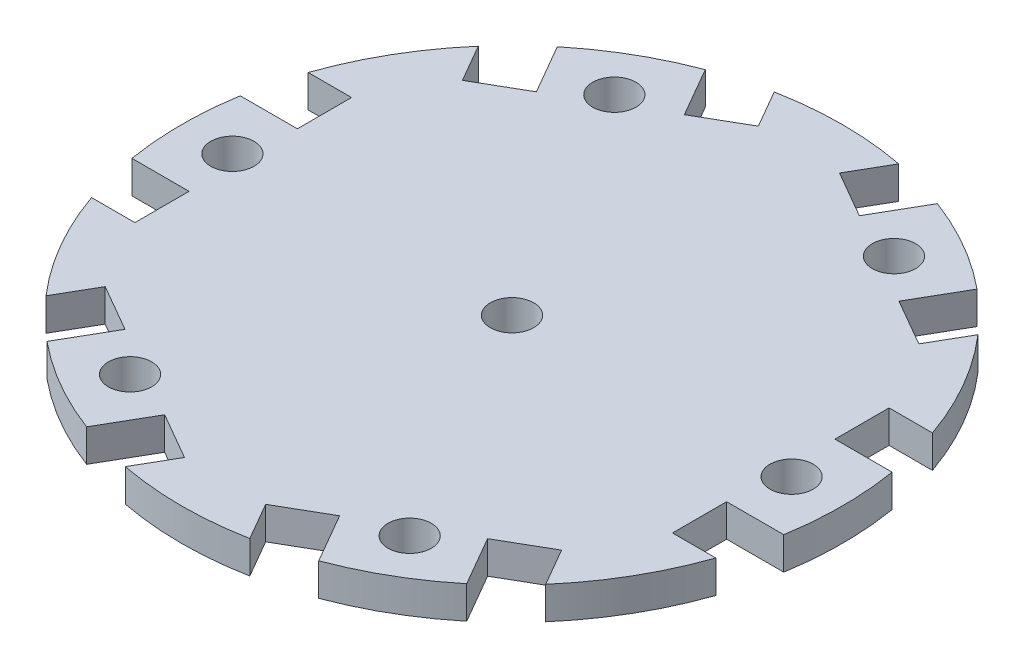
ISO-10303-21;
HEADER;
FILE_DESCRIPTION(('STEP AP214'),'2;1');
FILE_NAME('part.step','',(''),(''),'','','');
FILE_SCHEMA(('AUTOMOTIVE_DESIGN { 1 0 10303 214 1 1 1 1 }'));
ENDSEC;
DATA;
#1=APPLICATION_CONTEXT('core data for automotive mechanical design processes');
#2=APPLICATION_PROTOCOL_DEFINITION('international standard','automotive_design',2000,#1);
#3=PRODUCT_CONTEXT('',#1,'mechanical');
#4=PRODUCT('Part','Part','',(#3));
#5=PRODUCT_RELATED_PRODUCT_CATEGORY('part','',(#4));
#6=PRODUCT_DEFINITION_FORMATION('','',#4);
#7=PRODUCT_DEFINITION_CONTEXT('part definition',#1,'design');
#8=PRODUCT_DEFINITION('design','',#6,#7);
#9=PRODUCT_DEFINITION_SHAPE('','',#8);
#10=(LENGTH_UNIT() NAMED_UNIT(*) SI_UNIT(.MILLI.,.METRE.));
#11=(NAMED_UNIT(*) PLANE_ANGLE_UNIT() SI_UNIT($,.RADIAN.));
#12=(NAMED_UNIT(*) SI_UNIT($,.STERADIAN.) SOLID_ANGLE_UNIT());
#13=UNCERTAINTY_MEASURE_WITH_UNIT(LENGTH_MEASURE(1.E-05),#10,'distance_accuracy_value','');
#14=(GEOMETRIC_REPRESENTATION_CONTEXT(3) GLOBAL_UNCERTAINTY_ASSIGNED_CONTEXT((#13)) GLOBAL_UNIT_ASSIGNED_CONTEXT((#10,
#11,#12)) REPRESENTATION_CONTEXT('',''));
#15=CARTESIAN_POINT('',(0.,0.,0.));
#16=DIRECTION('',(0.,0.,1.));
#17=DIRECTION('',(1.,0.,0.));
#18=AXIS2_PLACEMENT_3D('',#15,#16,#17);
#19=CARTESIAN_POINT('',(0.,3.,0.));
#20=DIRECTION('',(0.,1.,0.));
#21=DIRECTION('',(0.,0.,1.));
#22=AXIS2_PLACEMENT_3D('',#19,#20,#21);
#23=PLANE('',#22);
#24=CARTESIAN_POINT('',(12.907029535,3.,22.3556309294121));
#25=DIRECTION('',(0.,1.,0.));
#26=DIRECTION('',(0.,0.,1.));
#27=AXIS2_PLACEMENT_3D('',#24,#25,#26);
#28=CIRCLE('',#27,2.00000000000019);
#29=CARTESIAN_POINT('',(12.907029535,3.,24.3556309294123));
#30=VERTEX_POINT('',#29);
#31=EDGE_CURVE('E701',#30,#30,#28,.T.);
#32=ORIENTED_EDGE('',*,*,#31,.F.);
#33=EDGE_LOOP('',(#32));
#34=FACE_BOUND('',#33,.T.);
#35=CARTESIAN_POINT('',(-12.907029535,3.,-22.3556309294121));
#36=DIRECTION('',(0.,1.,0.));
#37=DIRECTION('',(0.,0.,1.));
#38=AXIS2_PLACEMENT_3D('',#35,#36,#37);
#39=CIRCLE('',#38,1.99999999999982);
#40=CARTESIAN_POINT('',(-12.907029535,3.,-20.3556309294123));
#41=VERTEX_POINT('',#40);
#42=EDGE_CURVE('E681',#41,#41,#39,.F.);
#43=ORIENTED_EDGE('',*,*,#42,.T.);
#44=EDGE_LOOP('',(#43));
#45=FACE_BOUND('',#44,.T.);
#46=DIRECTION('',(0.866025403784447,0.,0.499999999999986));
#47=VECTOR('',#46,1.);
#48=CARTESIAN_POINT('',(12.4070295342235,3.,-21.4896055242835));
#49=LINE('',#48,#47);
#50=CARTESIAN_POINT('',(16.7371565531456,3.,-18.9896055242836));
#51=VERTEX_POINT('',#50);
#52=CARTESIAN_POINT('',(21.0672835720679,3.,-16.4896055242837));
#53=VERTEX_POINT('',#52);
#54=EDGE_CURVE('E358',#51,#53,#49,.T.);
#55=ORIENTED_EDGE('',*,*,#54,.F.);
#56=DIRECTION('',(0.499999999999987,0.,-0.866025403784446));
#57=VECTOR('',#56,1.);
#58=CARTESIAN_POINT('',(4.33012701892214,3.,2.49999999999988));
#59=LINE('',#58,#57);
#60=CARTESIAN_POINT('',(19.3738134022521,3.,-23.5564291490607));
#61=VERTEX_POINT('',#60);
#62=EDGE_CURVE('E355',#51,#61,#59,.T.);
#63=ORIENTED_EDGE('',*,*,#62,.T.);
#64=CARTESIAN_POINT('',(0.,3.,0.));
#65=DIRECTION('',(0.,1.,0.));
#66=DIRECTION('',(0.,0.,1.));
#67=AXIS2_PLACEMENT_3D('',#64,#65,#66);
#68=CIRCLE('',#67,30.5);
#69=CARTESIAN_POINT('',(10.7135593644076,3.,-28.5564291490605));
#70=VERTEX_POINT('',#69);
#71=EDGE_CURVE('E66',#61,#70,#68,.T.);
#72=ORIENTED_EDGE('',*,*,#71,.T.);
#73=DIRECTION('',(0.499999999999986,0.,-0.866025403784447));
#74=VECTOR('',#73,1.);
#75=CARTESIAN_POINT('',(-4.33012701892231,3.,-2.49999999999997));
#76=LINE('',#75,#74);
#77=CARTESIAN_POINT('',(8.07690251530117,3.,-23.9896055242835));
#78=VERTEX_POINT('',#77);
#79=EDGE_CURVE('E383',#78,#70,#76,.T.);
#80=ORIENTED_EDGE('',*,*,#79,.F.);
#81=DIRECTION('',(-0.866025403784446,0.,-0.499999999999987));
#82=VECTOR('',#81,1.);
#83=CARTESIAN_POINT('',(12.4070295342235,3.,-21.4896055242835));
#84=LINE('',#83,#82);
#85=CARTESIAN_POINT('',(3.74677549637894,3.,-26.4896055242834));
#86=VERTEX_POINT('',#85);
#87=EDGE_CURVE('E380',#78,#86,#84,.T.);
#88=ORIENTED_EDGE('',*,*,#87,.T.);
#89=DIRECTION('',(0.499999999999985,0.,-0.866025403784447));
#90=VECTOR('',#89,1.);
#91=CARTESIAN_POINT('',(-8.66025403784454,3.,-4.99999999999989));
#92=LINE('',#91,#90);
#93=CARTESIAN_POINT('',(5.74677549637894,3.,-29.9537071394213));
#94=VERTEX_POINT('',#93);
#95=EDGE_CURVE('E377',#86,#94,#92,.T.);
#96=ORIENTED_EDGE('',*,*,#95,.T.);
#97=CARTESIAN_POINT('',(-5.74677549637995,3.,-29.9537071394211));
#98=VERTEX_POINT('',#97);
#99=EDGE_CURVE('E913',#94,#98,#68,.T.);
#100=ORIENTED_EDGE('',*,*,#99,.T.);
#101=DIRECTION('',(-0.500000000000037,0.,-0.866025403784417));
#102=VECTOR('',#101,1.);
#103=CARTESIAN_POINT('',(8.66025403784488,3.,-5.00000000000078));
#104=LINE('',#103,#102);
#105=CARTESIAN_POINT('',(-3.74677549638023,3.,-26.4896055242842));
#106=VERTEX_POINT('',#105);
#107=EDGE_CURVE('E400',#106,#98,#104,.T.);
#108=ORIENTED_EDGE('',*,*,#107,.F.);
#109=DIRECTION('',(0.866025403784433,0.,-0.50000000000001));
#110=VECTOR('',#109,1.);
#111=CARTESIAN_POINT('',(-12.4070295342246,3.,-21.489605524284));
#112=LINE('',#111,#110);
#113=CARTESIAN_POINT('',(-8.07690251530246,3.,-23.9896055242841));
#114=VERTEX_POINT('',#113);
#115=EDGE_CURVE('E397',#114,#106,#112,.T.);
#116=ORIENTED_EDGE('',*,*,#115,.F.);
#117=DIRECTION('',(-0.50000000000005,0.,-0.86602540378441));
#118=VECTOR('',#117,1.);
#119=CARTESIAN_POINT('',(4.33012701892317,3.,-2.50000000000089));
#120=LINE('',#119,#118);
#121=CARTESIAN_POINT('',(-10.7135593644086,3.,-28.5564291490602));
#122=VERTEX_POINT('',#121);
#123=EDGE_CURVE('E394',#114,#122,#120,.T.);
#124=ORIENTED_EDGE('',*,*,#123,.T.);
#125=CARTESIAN_POINT('',(-19.3738134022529,3.,-23.55642914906));
#126=VERTEX_POINT('',#125);
#127=EDGE_CURVE('E915',#122,#126,#68,.T.);
#128=ORIENTED_EDGE('',*,*,#127,.T.);
#129=DIRECTION('',(-0.500000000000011,0.,-0.866025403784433));
#130=VECTOR('',#129,1.);
#131=CARTESIAN_POINT('',(-4.3301270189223,3.,2.50000000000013));
#132=LINE('',#131,#130);
#133=CARTESIAN_POINT('',(-16.737156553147,3.,-18.9896055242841));
#134=VERTEX_POINT('',#133);
#135=EDGE_CURVE('E412',#134,#126,#132,.T.);
#136=ORIENTED_EDGE('',*,*,#135,.F.);
#137=DIRECTION('',(-0.866025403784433,0.,0.50000000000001));
#138=VECTOR('',#137,1.);
#139=CARTESIAN_POINT('',(-12.4070295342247,3.,-21.4896055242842));
#140=LINE('',#139,#138);
#141=CARTESIAN_POINT('',(-21.0672835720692,3.,-16.489605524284));
#142=VERTEX_POINT('',#141);
#143=EDGE_CURVE('E418',#134,#142,#140,.T.);
#144=ORIENTED_EDGE('',*,*,#143,.T.);
#145=DIRECTION('',(-0.499999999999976,0.,-0.866025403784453));
#146=VECTOR('',#145,1.);
#147=CARTESIAN_POINT('',(-8.6602540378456,3.,5.00000000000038));
#148=LINE('',#147,#146);
#149=CARTESIAN_POINT('',(-23.0672835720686,3.,-19.9537071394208));
#150=VERTEX_POINT('',#149);
#151=EDGE_CURVE('E415',#142,#150,#148,.T.);
#152=ORIENTED_EDGE('',*,*,#151,.T.);
#153=CARTESIAN_POINT('',(-28.8140590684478,3.,-10.));
#154=VERTEX_POINT('',#153);
#155=EDGE_CURVE('E584',#150,#154,#68,.T.);
#156=ORIENTED_EDGE('',*,*,#155,.T.);
#157=DIRECTION('',(-1.,0.,0.));
#158=VECTOR('',#157,1.);
#159=CARTESIAN_POINT('',(0.,3.,-10.));
#160=LINE('',#159,#158);
#161=CARTESIAN_POINT('',(-24.8140590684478,3.,-10.));
#162=VERTEX_POINT('',#161);
#163=EDGE_CURVE('E560',#162,#154,#160,.T.);
#164=ORIENTED_EDGE('',*,*,#163,.F.);
#165=DIRECTION('',(0.,0.,-1.));
#166=VECTOR('',#165,1.);
#167=CARTESIAN_POINT('',(-24.8140590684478,3.,0.));
#168=LINE('',#167,#166);
#169=CARTESIAN_POINT('',(-24.8140590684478,3.,-5.));
#170=VERTEX_POINT('',#169);
#171=EDGE_CURVE('E557',#170,#162,#168,.T.);
#172=ORIENTED_EDGE('',*,*,#171,.F.);
#173=DIRECTION('',(-1.,0.,0.));
#174=VECTOR('',#173,1.);
#175=CARTESIAN_POINT('',(0.,3.,-5.));
#176=LINE('',#175,#174);
#177=CARTESIAN_POINT('',(-30.0873727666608,3.,-5.));
#178=VERTEX_POINT('',#177);
#179=EDGE_CURVE('E548',#170,#178,#176,.T.);
#180=ORIENTED_EDGE('',*,*,#179,.T.);
#181=CARTESIAN_POINT('',(-30.0873727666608,3.,5.));
#182=VERTEX_POINT('',#181);
#183=EDGE_CURVE('E576',#178,#182,#68,.T.);
#184=ORIENTED_EDGE('',*,*,#183,.T.);
#185=DIRECTION('',(-1.,0.,0.));
#186=VECTOR('',#185,1.);
#187=CARTESIAN_POINT('',(0.,3.,5.00000000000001));
#188=LINE('',#187,#186);
#189=CARTESIAN_POINT('',(-24.8140590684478,3.,5.));
#190=VERTEX_POINT('',#189);
#191=EDGE_CURVE('E430',#190,#182,#188,.T.);
#192=ORIENTED_EDGE('',*,*,#191,.F.);
#193=DIRECTION('',(0.,0.,1.));
#194=VECTOR('',#193,1.);
#195=CARTESIAN_POINT('',(-24.8140590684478,3.,0.));
#196=LINE('',#195,#194);
#197=CARTESIAN_POINT('',(-24.8140590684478,3.,10.));
#198=VERTEX_POINT('',#197);
#199=EDGE_CURVE('E435',#190,#198,#196,.T.);
#200=ORIENTED_EDGE('',*,*,#199,.T.);
#201=DIRECTION('',(-1.,0.,0.));
#202=VECTOR('',#201,1.);
#203=CARTESIAN_POINT('',(0.,3.,10.));
#204=LINE('',#203,#202);
#205=CARTESIAN_POINT('',(-28.8140590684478,3.,10.));
#206=VERTEX_POINT('',#205);
#207=EDGE_CURVE('E432',#198,#206,#204,.T.);
#208=ORIENTED_EDGE('',*,*,#207,.T.);
#209=CARTESIAN_POINT('',(-23.067283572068,3.,19.9537071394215));
#210=VERTEX_POINT('',#209);
#211=EDGE_CURVE('E580',#206,#210,#68,.T.);
#212=ORIENTED_EDGE('',*,*,#211,.T.);
#213=DIRECTION('',(-0.499999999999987,0.,0.866025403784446));
#214=VECTOR('',#213,1.);
#215=CARTESIAN_POINT('',(-8.6602540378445,3.,-4.9999999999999));
#216=LINE('',#215,#214);
#217=CARTESIAN_POINT('',(-21.0672835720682,3.,16.4896055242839));
#218=VERTEX_POINT('',#217);
#219=EDGE_CURVE('E453',#218,#210,#216,.T.);
#220=ORIENTED_EDGE('',*,*,#219,.F.);
#221=DIRECTION('',(-0.866025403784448,0.,-0.499999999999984));
#222=VECTOR('',#221,1.);
#223=CARTESIAN_POINT('',(-12.4070295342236,3.,21.4896055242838));
#224=LINE('',#223,#222);
#225=CARTESIAN_POINT('',(-16.7371565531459,3.,18.9896055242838));
#226=VERTEX_POINT('',#225);
#227=EDGE_CURVE('E450',#226,#218,#224,.T.);
#228=ORIENTED_EDGE('',*,*,#227,.F.);
#229=DIRECTION('',(-0.499999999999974,0.,0.866025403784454));
#230=VECTOR('',#229,1.);
#231=CARTESIAN_POINT('',(-4.3301270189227,3.,-2.50000000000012));
#232=LINE('',#231,#230);
#233=CARTESIAN_POINT('',(-19.3738134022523,3.,23.5564291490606));
#234=VERTEX_POINT('',#233);
#235=EDGE_CURVE('E447',#226,#234,#232,.T.);
#236=ORIENTED_EDGE('',*,*,#235,.T.);
#237=CARTESIAN_POINT('',(-10.7135593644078,3.,28.5564291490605));
#238=VERTEX_POINT('',#237);
#239=EDGE_CURVE('E922',#234,#238,#68,.T.);
#240=ORIENTED_EDGE('',*,*,#239,.T.);
#241=DIRECTION('',(-0.5,0.,0.866025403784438));
#242=VECTOR('',#241,1.);
#243=CARTESIAN_POINT('',(4.3301270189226,3.,2.50000000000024));
#244=LINE('',#243,#242);
#245=CARTESIAN_POINT('',(-8.07690251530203,3.,23.9896055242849));
#246=VERTEX_POINT('',#245);
#247=EDGE_CURVE('E465',#246,#238,#244,.T.);
#248=ORIENTED_EDGE('',*,*,#247,.F.);
#249=DIRECTION('',(0.866025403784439,0.,0.5));
#250=VECTOR('',#249,1.);
#251=CARTESIAN_POINT('',(-12.4070295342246,3.,21.4896055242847));
#252=LINE('',#251,#250);
#253=CARTESIAN_POINT('',(-3.74677549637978,3.,26.4896055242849));
#254=VERTEX_POINT('',#253);
#255=EDGE_CURVE('E471',#246,#254,#252,.T.);
#256=ORIENTED_EDGE('',*,*,#255,.T.);
#257=DIRECTION('',(-0.500000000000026,0.,0.866025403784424));
#258=VECTOR('',#257,1.);
#259=CARTESIAN_POINT('',(8.66025403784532,3.,5.00000000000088));
#260=LINE('',#259,#258);
#261=CARTESIAN_POINT('',(-5.74677549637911,3.,29.9537071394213));
#262=VERTEX_POINT('',#261);
#263=EDGE_CURVE('E468',#254,#262,#260,.T.);
#264=ORIENTED_EDGE('',*,*,#263,.T.);
#265=CARTESIAN_POINT('',(5.74677549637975,3.,29.9537071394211));
#266=VERTEX_POINT('',#265);
#267=EDGE_CURVE('E925',#262,#266,#68,.T.);
#268=ORIENTED_EDGE('',*,*,#267,.T.);
#269=DIRECTION('',(0.500000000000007,0.,0.866025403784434));
#270=VECTOR('',#269,1.);
#271=CARTESIAN_POINT('',(-8.66025403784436,3.,5.00000000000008));
#272=LINE('',#271,#270);
#273=CARTESIAN_POINT('',(3.74677549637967,3.,26.4896055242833));
#274=VERTEX_POINT('',#273);
#275=EDGE_CURVE('E486',#274,#266,#272,.T.);
#276=ORIENTED_EDGE('',*,*,#275,.F.);
#277=DIRECTION('',(-0.866025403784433,0.,0.50000000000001));
#278=VECTOR('',#277,1.);
#279=CARTESIAN_POINT('',(12.4070295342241,3.,21.4896055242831));
#280=LINE('',#279,#278);
#281=CARTESIAN_POINT('',(8.07690251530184,3.,23.9896055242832));
#282=VERTEX_POINT('',#281);
#283=EDGE_CURVE('E483',#282,#274,#280,.T.);
#284=ORIENTED_EDGE('',*,*,#283,.F.);
#285=DIRECTION('',(0.500000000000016,0.,0.866025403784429));
#286=VECTOR('',#285,1.);
#287=CARTESIAN_POINT('',(-4.33012701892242,3.,2.50000000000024));
#288=LINE('',#287,#286);
#289=CARTESIAN_POINT('',(10.7135593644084,3.,28.5564291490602));
#290=VERTEX_POINT('',#289);
#291=EDGE_CURVE('E489',#282,#290,#288,.T.);
#292=ORIENTED_EDGE('',*,*,#291,.T.);
#293=CARTESIAN_POINT('',(19.3738134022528,3.,23.5564291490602));
#294=VERTEX_POINT('',#293);
#295=EDGE_CURVE('E928',#290,#294,#68,.T.);
#296=ORIENTED_EDGE('',*,*,#295,.T.);
#297=DIRECTION('',(0.50000000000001,0.,0.866025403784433));
#298=VECTOR('',#297,1.);
#299=CARTESIAN_POINT('',(4.33012701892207,3.,-2.5));
#300=LINE('',#299,#298);
#301=CARTESIAN_POINT('',(16.7371565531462,3.,18.9896055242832));
#302=VERTEX_POINT('',#301);
#303=EDGE_CURVE('E507',#302,#294,#300,.T.);
#304=ORIENTED_EDGE('',*,*,#303,.F.);
#305=DIRECTION('',(0.866025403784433,0.,-0.500000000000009));
#306=VECTOR('',#305,1.);
#307=CARTESIAN_POINT('',(12.4070295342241,3.,21.4896055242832));
#308=LINE('',#307,#306);
#309=CARTESIAN_POINT('',(21.0672835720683,3.,16.4896055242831));
#310=VERTEX_POINT('',#309);
#311=EDGE_CURVE('E504',#302,#310,#308,.T.);
#312=ORIENTED_EDGE('',*,*,#311,.T.);
#313=DIRECTION('',(0.50000000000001,0.,0.866025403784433));
#314=VECTOR('',#313,1.);
#315=CARTESIAN_POINT('',(8.66025403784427,3.,-5.00000000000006));
#316=LINE('',#315,#314);
#317=CARTESIAN_POINT('',(23.0672835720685,3.,19.953707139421));
#318=VERTEX_POINT('',#317);
#319=EDGE_CURVE('E501',#310,#318,#316,.T.);
#320=ORIENTED_EDGE('',*,*,#319,.T.);
#321=CARTESIAN_POINT('',(28.8140590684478,3.,10.));
#322=VERTEX_POINT('',#321);
#323=EDGE_CURVE('E931',#318,#322,#68,.T.);
#324=ORIENTED_EDGE('',*,*,#323,.T.);
#325=DIRECTION('',(1.,0.,0.));
#326=VECTOR('',#325,1.);
#327=CARTESIAN_POINT('',(3.98986399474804E-13,3.,10.0000000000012));
#328=LINE('',#327,#326);
#329=CARTESIAN_POINT('',(24.8140590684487,3.,10.0000000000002));
#330=VERTEX_POINT('',#329);
#331=EDGE_CURVE('E522',#330,#322,#328,.T.);
#332=ORIENTED_EDGE('',*,*,#331,.F.);
#333=DIRECTION('',(0.,0.,1.));
#334=VECTOR('',#333,1.);
#335=CARTESIAN_POINT('',(24.8140590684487,3.,0.));
#336=LINE('',#335,#334);
#337=CARTESIAN_POINT('',(24.8140590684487,3.,5.00000000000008));
#338=VERTEX_POINT('',#337);
#339=EDGE_CURVE('E519',#338,#330,#336,.T.);
#340=ORIENTED_EDGE('',*,*,#339,.F.);
#341=DIRECTION('',(1.,0.,0.));
#342=VECTOR('',#341,1.);
#343=CARTESIAN_POINT('',(3.16750859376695E-13,3.,5.00000000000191));
#344=LINE('',#343,#342);
#345=CARTESIAN_POINT('',(30.0873727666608,3.,5.));
#346=VERTEX_POINT('',#345);
#347=EDGE_CURVE('E525',#338,#346,#344,.T.);
#348=ORIENTED_EDGE('',*,*,#347,.T.);
#349=CARTESIAN_POINT('',(30.0873727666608,3.,-5.));
#350=VERTEX_POINT('',#349);
#351=EDGE_CURVE('E914',#346,#350,#68,.T.);
#352=ORIENTED_EDGE('',*,*,#351,.T.);
#353=DIRECTION('',(1.,0.,0.));
#354=VECTOR('',#353,1.);
#355=CARTESIAN_POINT('',(0.,3.,-5.00000000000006));
#356=LINE('',#355,#354);
#357=CARTESIAN_POINT('',(24.8140590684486,3.,-5.00000000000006));
#358=VERTEX_POINT('',#357);
#359=EDGE_CURVE('E542',#358,#350,#356,.T.);
#360=ORIENTED_EDGE('',*,*,#359,.F.);
#361=DIRECTION('',(0.,0.,-1.));
#362=VECTOR('',#361,1.);
#363=CARTESIAN_POINT('',(24.8140590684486,3.,0.));
#364=LINE('',#363,#362);
#365=CARTESIAN_POINT('',(24.8140590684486,3.,-10.0000000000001));
#366=VERTEX_POINT('',#365);
#367=EDGE_CURVE('E539',#358,#366,#364,.T.);
#368=ORIENTED_EDGE('',*,*,#367,.T.);
#369=DIRECTION('',(1.,0.,0.));
#370=VECTOR('',#369,1.);
#371=CARTESIAN_POINT('',(3.12250225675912E-13,3.,-10.0000000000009));
#372=LINE('',#371,#370);
#373=CARTESIAN_POINT('',(28.8140590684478,3.,-10.));
#374=VERTEX_POINT('',#373);
#375=EDGE_CURVE('E537',#366,#374,#372,.T.);
#376=ORIENTED_EDGE('',*,*,#375,.T.);
#377=CARTESIAN_POINT('',(23.0672835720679,3.,-19.9537071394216));
#378=VERTEX_POINT('',#377);
#379=EDGE_CURVE('E368',#374,#378,#68,.T.);
#380=ORIENTED_EDGE('',*,*,#379,.T.);
#381=DIRECTION('',(0.499999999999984,0.,-0.866025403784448));
#382=VECTOR('',#381,1.);
#383=CARTESIAN_POINT('',(8.66025403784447,3.,4.99999999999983));
#384=LINE('',#383,#382);
#385=EDGE_CURVE('E58',#53,#378,#384,.T.);
#386=ORIENTED_EDGE('',*,*,#385,.F.);
#387=EDGE_LOOP('',(#55,#63,#72,#80,#88,#96,#100,#108,#116,#124,#128,#136,#144,#152,#156,#164,
#172,#180,#184,#192,#200,#208,#212,#220,#228,#236,#240,#248,#256,#264,#268,#276,#284,#292,#296,
#304,#312,#320,#324,#332,#340,#348,#352,#360,#368,#376,#380,#386));
#388=FACE_BOUND('',#387,.T.);
#389=CARTESIAN_POINT('',(0.,3.,0.));
#390=DIRECTION('',(0.,1.,0.));
#391=DIRECTION('',(0.,0.,1.));
#392=AXIS2_PLACEMENT_3D('',#389,#390,#391);
#393=CIRCLE('',#392,2.);
#394=CARTESIAN_POINT('',(0.,3.,2.));
#395=VERTEX_POINT('',#394);
#396=EDGE_CURVE('E566',#395,#395,#393,.T.);
#397=ORIENTED_EDGE('',*,*,#396,.F.);
#398=EDGE_LOOP('',(#397));
#399=FACE_BOUND('',#398,.T.);
#400=CARTESIAN_POINT('',(-25.81405907,3.,0.));
#401=DIRECTION('',(0.,1.,0.));
#402=DIRECTION('',(0.,0.,1.));
#403=AXIS2_PLACEMENT_3D('',#400,#401,#402);
#404=CIRCLE('',#403,2.);
#405=CARTESIAN_POINT('',(-25.81405907,3.,2.));
#406=VERTEX_POINT('',#405);
#407=EDGE_CURVE('E677',#406,#406,#404,.F.);
#408=ORIENTED_EDGE('',*,*,#407,.T.);
#409=EDGE_LOOP('',(#408));
#410=FACE_BOUND('',#409,.T.);
#411=CARTESIAN_POINT('',(12.907029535,3.,-22.3556309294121));
#412=DIRECTION('',(0.,1.,0.));
#413=DIRECTION('',(0.,0.,1.));
#414=AXIS2_PLACEMENT_3D('',#411,#412,#413);
#415=CIRCLE('',#414,2.00000000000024);
#416=CARTESIAN_POINT('',(12.907029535,3.,-20.3556309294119));
#417=VERTEX_POINT('',#416);
#418=EDGE_CURVE('E685',#417,#417,#415,.T.);
#419=ORIENTED_EDGE('',*,*,#418,.F.);
#420=EDGE_LOOP('',(#419));
#421=FACE_BOUND('',#420,.T.);
#422=CARTESIAN_POINT('',(25.81405907,3.,0.));
#423=DIRECTION('',(0.,1.,0.));
#424=DIRECTION('',(0.,0.,1.));
#425=AXIS2_PLACEMENT_3D('',#422,#423,#424);
#426=CIRCLE('',#425,2.);
#427=CARTESIAN_POINT('',(25.81405907,3.,1.99999999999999));
#428=VERTEX_POINT('',#427);
#429=EDGE_CURVE('E688',#428,#428,#426,.T.);
#430=ORIENTED_EDGE('',*,*,#429,.F.);
#431=EDGE_LOOP('',(#430));
#432=FACE_BOUND('',#431,.T.);
#433=CARTESIAN_POINT('',(-12.907029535,3.,22.3556309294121));
#434=DIRECTION('',(0.,1.,0.));
#435=DIRECTION('',(0.,0.,1.));
#436=AXIS2_PLACEMENT_3D('',#433,#434,#435);
#437=CIRCLE('',#436,1.99999999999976);
#438=CARTESIAN_POINT('',(-12.907029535,3.,24.3556309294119));
#439=VERTEX_POINT('',#438);
#440=EDGE_CURVE('E691',#439,#439,#437,.F.);
#441=ORIENTED_EDGE('',*,*,#440,.T.);
#442=EDGE_LOOP('',(#441));
#443=FACE_BOUND('',#442,.T.);
#444=ADVANCED_FACE('F41',(#34,#45,#388,#399,#410,#421,#432,#443),#23,.T.);
#445=CARTESIAN_POINT('',(0.,0.,0.));
#446=DIRECTION('',(0.,1.,0.));
#447=DIRECTION('',(0.,0.,1.));
#448=AXIS2_PLACEMENT_3D('',#445,#446,#447);
#449=PLANE('',#448);
#450=CARTESIAN_POINT('',(12.907029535,0.,22.3556309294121));
#451=DIRECTION('',(0.,1.,0.));
#452=DIRECTION('',(0.,0.,1.));
#453=AXIS2_PLACEMENT_3D('',#450,#451,#452);
#454=CIRCLE('',#453,2.00000000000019);
#455=CARTESIAN_POINT('',(12.907029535,0.,24.3556309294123));
#456=VERTEX_POINT('',#455);
#457=EDGE_CURVE('E45',#456,#456,#454,.T.);
#458=ORIENTED_EDGE('',*,*,#457,.T.);
#459=EDGE_LOOP('',(#458));
#460=FACE_BOUND('',#459,.T.);
#461=CARTESIAN_POINT('',(-12.907029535,0.,-22.3556309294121));
#462=DIRECTION('',(0.,1.,0.));
#463=DIRECTION('',(0.,0.,1.));
#464=AXIS2_PLACEMENT_3D('',#461,#462,#463);
#465=CIRCLE('',#464,1.99999999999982);
#466=CARTESIAN_POINT('',(-12.907029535,0.,-20.3556309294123));
#467=VERTEX_POINT('',#466);
#468=EDGE_CURVE('E678',#467,#467,#465,.F.);
#469=ORIENTED_EDGE('',*,*,#468,.F.);
#470=EDGE_LOOP('',(#469));
#471=FACE_BOUND('',#470,.T.);
#472=DIRECTION('',(0.499999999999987,0.,-0.866025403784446));
#473=VECTOR('',#472,1.);
#474=CARTESIAN_POINT('',(4.33012701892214,0.,2.49999999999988));
#475=LINE('',#474,#473);
#476=CARTESIAN_POINT('',(16.7371565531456,0.,-18.9896055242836));
#477=VERTEX_POINT('',#476);
#478=CARTESIAN_POINT('',(19.3738134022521,0.,-23.5564291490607));
#479=VERTEX_POINT('',#478);
#480=EDGE_CURVE('E375',#477,#479,#475,.T.);
#481=ORIENTED_EDGE('',*,*,#480,.F.);
#482=DIRECTION('',(0.866025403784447,0.,0.499999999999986));
#483=VECTOR('',#482,1.);
#484=CARTESIAN_POINT('',(12.4070295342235,0.,-21.4896055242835));
#485=LINE('',#484,#483);
#486=CARTESIAN_POINT('',(21.0672835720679,0.,-16.4896055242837));
#487=VERTEX_POINT('',#486);
#488=EDGE_CURVE('E12',#477,#487,#485,.T.);
#489=ORIENTED_EDGE('',*,*,#488,.T.);
#490=DIRECTION('',(0.499999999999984,0.,-0.866025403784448));
#491=VECTOR('',#490,1.);
#492=CARTESIAN_POINT('',(8.66025403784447,0.,4.99999999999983));
#493=LINE('',#492,#491);
#494=CARTESIAN_POINT('',(23.0672835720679,0.,-19.9537071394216));
#495=VERTEX_POINT('',#494);
#496=EDGE_CURVE('E352',#487,#495,#493,.T.);
#497=ORIENTED_EDGE('',*,*,#496,.T.);
#498=CARTESIAN_POINT('',(0.,0.,0.));
#499=DIRECTION('',(0.,1.,0.));
#500=DIRECTION('',(0.,0.,1.));
#501=AXIS2_PLACEMENT_3D('',#498,#499,#500);
#502=CIRCLE('',#501,30.5);
#503=CARTESIAN_POINT('',(28.8140590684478,0.,-10.));
#504=VERTEX_POINT('',#503);
#505=EDGE_CURVE('E587',#504,#495,#502,.T.);
#506=ORIENTED_EDGE('',*,*,#505,.F.);
#507=DIRECTION('',(1.,0.,0.));
#508=VECTOR('',#507,1.);
#509=CARTESIAN_POINT('',(3.12250225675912E-13,0.,-10.0000000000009));
#510=LINE('',#509,#508);
#511=CARTESIAN_POINT('',(24.8140590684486,0.,-10.0000000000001));
#512=VERTEX_POINT('',#511);
#513=EDGE_CURVE('E603',#512,#504,#510,.T.);
#514=ORIENTED_EDGE('',*,*,#513,.F.);
#515=DIRECTION('',(0.,0.,-1.));
#516=VECTOR('',#515,1.);
#517=CARTESIAN_POINT('',(24.8140590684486,0.,0.));
#518=LINE('',#517,#516);
#519=CARTESIAN_POINT('',(24.8140590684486,0.,-5.00000000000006));
#520=VERTEX_POINT('',#519);
#521=EDGE_CURVE('E598',#520,#512,#518,.T.);
#522=ORIENTED_EDGE('',*,*,#521,.F.);
#523=DIRECTION('',(1.,0.,0.));
#524=VECTOR('',#523,1.);
#525=CARTESIAN_POINT('',(0.,0.,-5.00000000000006));
#526=LINE('',#525,#524);
#527=CARTESIAN_POINT('',(30.0873727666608,0.,-5.));
#528=VERTEX_POINT('',#527);
#529=EDGE_CURVE('E600',#520,#528,#526,.T.);
#530=ORIENTED_EDGE('',*,*,#529,.T.);
#531=CARTESIAN_POINT('',(30.0873727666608,0.,5.));
#532=VERTEX_POINT('',#531);
#533=EDGE_CURVE('E947',#532,#528,#502,.T.);
#534=ORIENTED_EDGE('',*,*,#533,.F.);
#535=DIRECTION('',(1.,0.,0.));
#536=VECTOR('',#535,1.);
#537=CARTESIAN_POINT('',(3.16750859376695E-13,0.,5.00000000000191));
#538=LINE('',#537,#536);
#539=CARTESIAN_POINT('',(24.8140590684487,0.,5.00000000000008));
#540=VERTEX_POINT('',#539);
#541=EDGE_CURVE('E535',#540,#532,#538,.T.);
#542=ORIENTED_EDGE('',*,*,#541,.F.);
#543=DIRECTION('',(0.,0.,1.));
#544=VECTOR('',#543,1.);
#545=CARTESIAN_POINT('',(24.8140590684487,0.,0.));
#546=LINE('',#545,#544);
#547=CARTESIAN_POINT('',(24.8140590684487,0.,10.0000000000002));
#548=VERTEX_POINT('',#547);
#549=EDGE_CURVE('E610',#540,#548,#546,.T.);
#550=ORIENTED_EDGE('',*,*,#549,.T.);
#551=DIRECTION('',(1.,0.,0.));
#552=VECTOR('',#551,1.);
#553=CARTESIAN_POINT('',(3.98986399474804E-13,0.,10.0000000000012));
#554=LINE('',#553,#552);
#555=CARTESIAN_POINT('',(28.8140590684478,0.,10.));
#556=VERTEX_POINT('',#555);
#557=EDGE_CURVE('E531',#548,#556,#554,.T.);
#558=ORIENTED_EDGE('',*,*,#557,.T.);
#559=CARTESIAN_POINT('',(23.0672835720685,0.,19.953707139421));
#560=VERTEX_POINT('',#559);
#561=EDGE_CURVE('E949',#560,#556,#502,.T.);
#562=ORIENTED_EDGE('',*,*,#561,.F.);
#563=DIRECTION('',(0.50000000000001,0.,0.866025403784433));
#564=VECTOR('',#563,1.);
#565=CARTESIAN_POINT('',(8.66025403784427,0.,-5.00000000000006));
#566=LINE('',#565,#564);
#567=CARTESIAN_POINT('',(21.0672835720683,0.,16.4896055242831));
#568=VERTEX_POINT('',#567);
#569=EDGE_CURVE('E517',#568,#560,#566,.T.);
#570=ORIENTED_EDGE('',*,*,#569,.F.);
#571=DIRECTION('',(0.866025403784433,0.,-0.500000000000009));
#572=VECTOR('',#571,1.);
#573=CARTESIAN_POINT('',(12.4070295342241,0.,21.4896055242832));
#574=LINE('',#573,#572);
#575=CARTESIAN_POINT('',(16.7371565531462,0.,18.9896055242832));
#576=VERTEX_POINT('',#575);
#577=EDGE_CURVE('E618',#576,#568,#574,.T.);
#578=ORIENTED_EDGE('',*,*,#577,.F.);
#579=DIRECTION('',(0.50000000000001,0.,0.866025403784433));
#580=VECTOR('',#579,1.);
#581=CARTESIAN_POINT('',(4.33012701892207,0.,-2.5));
#582=LINE('',#581,#580);
#583=CARTESIAN_POINT('',(19.3738134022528,0.,23.5564291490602));
#584=VERTEX_POINT('',#583);
#585=EDGE_CURVE('E513',#576,#584,#582,.T.);
#586=ORIENTED_EDGE('',*,*,#585,.T.);
#587=CARTESIAN_POINT('',(10.7135593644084,0.,28.5564291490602));
#588=VERTEX_POINT('',#587);
#589=EDGE_CURVE('E950',#588,#584,#502,.T.);
#590=ORIENTED_EDGE('',*,*,#589,.F.);
#591=DIRECTION('',(0.500000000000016,0.,0.866025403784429));
#592=VECTOR('',#591,1.);
#593=CARTESIAN_POINT('',(-4.33012701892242,0.,2.50000000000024));
#594=LINE('',#593,#592);
#595=CARTESIAN_POINT('',(8.07690251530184,0.,23.9896055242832));
#596=VERTEX_POINT('',#595);
#597=EDGE_CURVE('E499',#596,#588,#594,.T.);
#598=ORIENTED_EDGE('',*,*,#597,.F.);
#599=DIRECTION('',(-0.866025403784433,0.,0.50000000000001));
#600=VECTOR('',#599,1.);
#601=CARTESIAN_POINT('',(12.4070295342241,0.,21.4896055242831));
#602=LINE('',#601,#600);
#603=CARTESIAN_POINT('',(3.74677549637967,0.,26.4896055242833));
#604=VERTEX_POINT('',#603);
#605=EDGE_CURVE('E625',#596,#604,#602,.T.);
#606=ORIENTED_EDGE('',*,*,#605,.T.);
#607=DIRECTION('',(0.500000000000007,0.,0.866025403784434));
#608=VECTOR('',#607,1.);
#609=CARTESIAN_POINT('',(-8.66025403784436,0.,5.00000000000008));
#610=LINE('',#609,#608);
#611=CARTESIAN_POINT('',(5.74677549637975,0.,29.9537071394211));
#612=VERTEX_POINT('',#611);
#613=EDGE_CURVE('E495',#604,#612,#610,.T.);
#614=ORIENTED_EDGE('',*,*,#613,.T.);
#615=CARTESIAN_POINT('',(-5.74677549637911,0.,29.9537071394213));
#616=VERTEX_POINT('',#615);
#617=EDGE_CURVE('E974',#616,#612,#502,.T.);
#618=ORIENTED_EDGE('',*,*,#617,.F.);
#619=DIRECTION('',(-0.500000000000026,0.,0.866025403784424));
#620=VECTOR('',#619,1.);
#621=CARTESIAN_POINT('',(8.66025403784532,0.,5.00000000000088));
#622=LINE('',#621,#620);
#623=CARTESIAN_POINT('',(-3.74677549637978,0.,26.4896055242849));
#624=VERTEX_POINT('',#623);
#625=EDGE_CURVE('E477',#624,#616,#622,.T.);
#626=ORIENTED_EDGE('',*,*,#625,.F.);
#627=DIRECTION('',(0.866025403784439,0.,0.5));
#628=VECTOR('',#627,1.);
#629=CARTESIAN_POINT('',(-12.4070295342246,0.,21.4896055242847));
#630=LINE('',#629,#628);
#631=CARTESIAN_POINT('',(-8.07690251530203,0.,23.9896055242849));
#632=VERTEX_POINT('',#631);
#633=EDGE_CURVE('E633',#632,#624,#630,.T.);
#634=ORIENTED_EDGE('',*,*,#633,.F.);
#635=DIRECTION('',(-0.5,0.,0.866025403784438));
#636=VECTOR('',#635,1.);
#637=CARTESIAN_POINT('',(4.3301270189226,0.,2.50000000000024));
#638=LINE('',#637,#636);
#639=CARTESIAN_POINT('',(-10.7135593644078,0.,28.5564291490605));
#640=VERTEX_POINT('',#639);
#641=EDGE_CURVE('E480',#632,#640,#638,.T.);
#642=ORIENTED_EDGE('',*,*,#641,.T.);
#643=CARTESIAN_POINT('',(-19.3738134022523,0.,23.5564291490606));
#644=VERTEX_POINT('',#643);
#645=EDGE_CURVE('E969',#644,#640,#502,.T.);
#646=ORIENTED_EDGE('',*,*,#645,.F.);
#647=DIRECTION('',(-0.499999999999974,0.,0.866025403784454));
#648=VECTOR('',#647,1.);
#649=CARTESIAN_POINT('',(-4.3301270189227,0.,-2.50000000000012));
#650=LINE('',#649,#648);
#651=CARTESIAN_POINT('',(-16.7371565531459,0.,18.9896055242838));
#652=VERTEX_POINT('',#651);
#653=EDGE_CURVE('E463',#652,#644,#650,.T.);
#654=ORIENTED_EDGE('',*,*,#653,.F.);
#655=DIRECTION('',(-0.866025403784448,0.,-0.499999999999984));
#656=VECTOR('',#655,1.);
#657=CARTESIAN_POINT('',(-12.4070295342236,0.,21.4896055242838));
#658=LINE('',#657,#656);
#659=CARTESIAN_POINT('',(-21.0672835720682,0.,16.4896055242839));
#660=VERTEX_POINT('',#659);
#661=EDGE_CURVE('E640',#652,#660,#658,.T.);
#662=ORIENTED_EDGE('',*,*,#661,.T.);
#663=DIRECTION('',(-0.499999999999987,0.,0.866025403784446));
#664=VECTOR('',#663,1.);
#665=CARTESIAN_POINT('',(-8.6602540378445,0.,-4.9999999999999));
#666=LINE('',#665,#664);
#667=CARTESIAN_POINT('',(-23.067283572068,0.,19.9537071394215));
#668=VERTEX_POINT('',#667);
#669=EDGE_CURVE('E459',#660,#668,#666,.T.);
#670=ORIENTED_EDGE('',*,*,#669,.T.);
#671=CARTESIAN_POINT('',(-28.8140590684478,0.,10.));
#672=VERTEX_POINT('',#671);
#673=EDGE_CURVE('E585',#672,#668,#502,.T.);
#674=ORIENTED_EDGE('',*,*,#673,.F.);
#675=DIRECTION('',(-1.,0.,0.));
#676=VECTOR('',#675,1.);
#677=CARTESIAN_POINT('',(0.,0.,10.));
#678=LINE('',#677,#676);
#679=CARTESIAN_POINT('',(-24.8140590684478,0.,10.));
#680=VERTEX_POINT('',#679);
#681=EDGE_CURVE('E441',#680,#672,#678,.T.);
#682=ORIENTED_EDGE('',*,*,#681,.F.);
#683=DIRECTION('',(0.,0.,1.));
#684=VECTOR('',#683,1.);
#685=CARTESIAN_POINT('',(-24.8140590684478,0.,0.));
#686=LINE('',#685,#684);
#687=CARTESIAN_POINT('',(-24.8140590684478,0.,5.));
#688=VERTEX_POINT('',#687);
#689=EDGE_CURVE('E648',#688,#680,#686,.T.);
#690=ORIENTED_EDGE('',*,*,#689,.F.);
#691=DIRECTION('',(-1.,0.,0.));
#692=VECTOR('',#691,1.);
#693=CARTESIAN_POINT('',(0.,0.,5.00000000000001));
#694=LINE('',#693,#692);
#695=CARTESIAN_POINT('',(-30.0873727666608,0.,5.));
#696=VERTEX_POINT('',#695);
#697=EDGE_CURVE('E444',#688,#696,#694,.T.);
#698=ORIENTED_EDGE('',*,*,#697,.T.);
#699=CARTESIAN_POINT('',(-30.0873727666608,0.,-5.));
#700=VERTEX_POINT('',#699);
#701=EDGE_CURVE('E581',#700,#696,#502,.T.);
#702=ORIENTED_EDGE('',*,*,#701,.F.);
#703=DIRECTION('',(-1.,0.,0.));
#704=VECTOR('',#703,1.);
#705=CARTESIAN_POINT('',(0.,0.,-5.));
#706=LINE('',#705,#704);
#707=CARTESIAN_POINT('',(-24.8140590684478,0.,-5.));
#708=VERTEX_POINT('',#707);
#709=EDGE_CURVE('E596',#708,#700,#706,.T.);
#710=ORIENTED_EDGE('',*,*,#709,.F.);
#711=DIRECTION('',(0.,0.,-1.));
#712=VECTOR('',#711,1.);
#713=CARTESIAN_POINT('',(-24.8140590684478,0.,0.));
#714=LINE('',#713,#712);
#715=CARTESIAN_POINT('',(-24.8140590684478,0.,-10.));
#716=VERTEX_POINT('',#715);
#717=EDGE_CURVE('E579',#708,#716,#714,.T.);
#718=ORIENTED_EDGE('',*,*,#717,.T.);
#719=DIRECTION('',(-1.,0.,0.));
#720=VECTOR('',#719,1.);
#721=CARTESIAN_POINT('',(0.,0.,-10.));
#722=LINE('',#721,#720);
#723=CARTESIAN_POINT('',(-28.8140590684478,0.,-10.));
#724=VERTEX_POINT('',#723);
#725=EDGE_CURVE('E593',#716,#724,#722,.T.);
#726=ORIENTED_EDGE('',*,*,#725,.T.);
#727=CARTESIAN_POINT('',(-23.0672835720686,0.,-19.9537071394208));
#728=VERTEX_POINT('',#727);
#729=EDGE_CURVE('E590',#728,#724,#502,.T.);
#730=ORIENTED_EDGE('',*,*,#729,.F.);
#731=DIRECTION('',(-0.499999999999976,0.,-0.866025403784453));
#732=VECTOR('',#731,1.);
#733=CARTESIAN_POINT('',(-8.6602540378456,0.,5.00000000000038));
#734=LINE('',#733,#732);
#735=CARTESIAN_POINT('',(-21.0672835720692,0.,-16.489605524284));
#736=VERTEX_POINT('',#735);
#737=EDGE_CURVE('E424',#736,#728,#734,.T.);
#738=ORIENTED_EDGE('',*,*,#737,.F.);
#739=DIRECTION('',(-0.866025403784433,0.,0.50000000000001));
#740=VECTOR('',#739,1.);
#741=CARTESIAN_POINT('',(-12.4070295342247,0.,-21.4896055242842));
#742=LINE('',#741,#740);
#743=CARTESIAN_POINT('',(-16.737156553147,0.,-18.9896055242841));
#744=VERTEX_POINT('',#743);
#745=EDGE_CURVE('E655',#744,#736,#742,.T.);
#746=ORIENTED_EDGE('',*,*,#745,.F.);
#747=DIRECTION('',(-0.500000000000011,0.,-0.866025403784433));
#748=VECTOR('',#747,1.);
#749=CARTESIAN_POINT('',(-4.3301270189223,0.,2.50000000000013));
#750=LINE('',#749,#748);
#751=CARTESIAN_POINT('',(-19.3738134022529,0.,-23.55642914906));
#752=VERTEX_POINT('',#751);
#753=EDGE_CURVE('E427',#744,#752,#750,.T.);
#754=ORIENTED_EDGE('',*,*,#753,.T.);
#755=CARTESIAN_POINT('',(-10.7135593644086,0.,-28.5564291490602));
#756=VERTEX_POINT('',#755);
#757=EDGE_CURVE('E956',#756,#752,#502,.T.);
#758=ORIENTED_EDGE('',*,*,#757,.F.);
#759=DIRECTION('',(-0.50000000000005,0.,-0.86602540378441));
#760=VECTOR('',#759,1.);
#761=CARTESIAN_POINT('',(4.33012701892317,0.,-2.50000000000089));
#762=LINE('',#761,#760);
#763=CARTESIAN_POINT('',(-8.07690251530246,0.,-23.9896055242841));
#764=VERTEX_POINT('',#763);
#765=EDGE_CURVE('E410',#764,#756,#762,.T.);
#766=ORIENTED_EDGE('',*,*,#765,.F.);
#767=DIRECTION('',(0.866025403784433,0.,-0.50000000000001));
#768=VECTOR('',#767,1.);
#769=CARTESIAN_POINT('',(-12.4070295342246,0.,-21.489605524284));
#770=LINE('',#769,#768);
#771=CARTESIAN_POINT('',(-3.74677549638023,0.,-26.4896055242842));
#772=VERTEX_POINT('',#771);
#773=EDGE_CURVE('E662',#764,#772,#770,.T.);
#774=ORIENTED_EDGE('',*,*,#773,.T.);
#775=DIRECTION('',(-0.500000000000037,0.,-0.866025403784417));
#776=VECTOR('',#775,1.);
#777=CARTESIAN_POINT('',(8.66025403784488,0.,-5.00000000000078));
#778=LINE('',#777,#776);
#779=CARTESIAN_POINT('',(-5.74677549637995,0.,-29.9537071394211));
#780=VERTEX_POINT('',#779);
#781=EDGE_CURVE('E406',#772,#780,#778,.T.);
#782=ORIENTED_EDGE('',*,*,#781,.T.);
#783=CARTESIAN_POINT('',(5.74677549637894,0.,-29.9537071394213));
#784=VERTEX_POINT('',#783);
#785=EDGE_CURVE('E955',#784,#780,#502,.T.);
#786=ORIENTED_EDGE('',*,*,#785,.F.);
#787=DIRECTION('',(0.499999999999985,0.,-0.866025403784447));
#788=VECTOR('',#787,1.);
#789=CARTESIAN_POINT('',(-8.66025403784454,0.,-4.99999999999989));
#790=LINE('',#789,#788);
#791=CARTESIAN_POINT('',(3.74677549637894,0.,-26.4896055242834));
#792=VERTEX_POINT('',#791);
#793=EDGE_CURVE('E392',#792,#784,#790,.T.);
#794=ORIENTED_EDGE('',*,*,#793,.F.);
#795=DIRECTION('',(-0.866025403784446,0.,-0.499999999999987));
#796=VECTOR('',#795,1.);
#797=CARTESIAN_POINT('',(12.4070295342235,0.,-21.4896055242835));
#798=LINE('',#797,#796);
#799=CARTESIAN_POINT('',(8.07690251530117,0.,-23.9896055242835));
#800=VERTEX_POINT('',#799);
#801=EDGE_CURVE('E670',#800,#792,#798,.T.);
#802=ORIENTED_EDGE('',*,*,#801,.F.);
#803=DIRECTION('',(0.499999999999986,0.,-0.866025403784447));
#804=VECTOR('',#803,1.);
#805=CARTESIAN_POINT('',(-4.33012701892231,0.,-2.49999999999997));
#806=LINE('',#805,#804);
#807=CARTESIAN_POINT('',(10.7135593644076,0.,-28.5564291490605));
#808=VERTEX_POINT('',#807);
#809=EDGE_CURVE('E388',#800,#808,#806,.T.);
#810=ORIENTED_EDGE('',*,*,#809,.T.);
#811=EDGE_CURVE('E586',#479,#808,#502,.T.);
#812=ORIENTED_EDGE('',*,*,#811,.F.);
#813=EDGE_LOOP('',(#481,#489,#497,#506,#514,#522,#530,#534,#542,#550,#558,#562,#570,#578,#586,
#590,#598,#606,#614,#618,#626,#634,#642,#646,#654,#662,#670,#674,#682,#690,#698,#702,#710,#718,
#726,#730,#738,#746,#754,#758,#766,#774,#782,#786,#794,#802,#810,#812));
#814=FACE_BOUND('',#813,.T.);
#815=CARTESIAN_POINT('',(0.,0.,0.));
#816=DIRECTION('',(0.,1.,0.));
#817=DIRECTION('',(0.,0.,1.));
#818=AXIS2_PLACEMENT_3D('',#815,#816,#817);
#819=CIRCLE('',#818,2.);
#820=CARTESIAN_POINT('',(0.,0.,2.));
#821=VERTEX_POINT('',#820);
#822=EDGE_CURVE('E575',#821,#821,#819,.T.);
#823=ORIENTED_EDGE('',*,*,#822,.T.);
#824=EDGE_LOOP('',(#823));
#825=FACE_BOUND('',#824,.T.);
#826=CARTESIAN_POINT('',(-25.81405907,0.,0.));
#827=DIRECTION('',(0.,1.,0.));
#828=DIRECTION('',(0.,0.,1.));
#829=AXIS2_PLACEMENT_3D('',#826,#827,#828);
#830=CIRCLE('',#829,2.);
#831=CARTESIAN_POINT('',(-25.81405907,0.,2.));
#832=VERTEX_POINT('',#831);
#833=EDGE_CURVE('E362',#832,#832,#830,.F.);
#834=ORIENTED_EDGE('',*,*,#833,.F.);
#835=EDGE_LOOP('',(#834));
#836=FACE_BOUND('',#835,.T.);
#837=CARTESIAN_POINT('',(12.907029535,0.,-22.3556309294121));
#838=DIRECTION('',(0.,1.,0.));
#839=DIRECTION('',(0.,0.,1.));
#840=AXIS2_PLACEMENT_3D('',#837,#838,#839);
#841=CIRCLE('',#840,2.00000000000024);
#842=CARTESIAN_POINT('',(12.907029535,0.,-20.3556309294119));
#843=VERTEX_POINT('',#842);
#844=EDGE_CURVE('E682',#843,#843,#841,.T.);
#845=ORIENTED_EDGE('',*,*,#844,.T.);
#846=EDGE_LOOP('',(#845));
#847=FACE_BOUND('',#846,.T.);
#848=CARTESIAN_POINT('',(25.81405907,0.,0.));
#849=DIRECTION('',(0.,1.,0.));
#850=DIRECTION('',(0.,0.,1.));
#851=AXIS2_PLACEMENT_3D('',#848,#849,#850);
#852=CIRCLE('',#851,2.);
#853=CARTESIAN_POINT('',(25.81405907,0.,1.99999999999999));
#854=VERTEX_POINT('',#853);
#855=EDGE_CURVE('E686',#854,#854,#852,.T.);
#856=ORIENTED_EDGE('',*,*,#855,.T.);
#857=EDGE_LOOP('',(#856));
#858=FACE_BOUND('',#857,.T.);
#859=CARTESIAN_POINT('',(-12.907029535,0.,22.3556309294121));
#860=DIRECTION('',(0.,1.,0.));
#861=DIRECTION('',(0.,0.,1.));
#862=AXIS2_PLACEMENT_3D('',#859,#860,#861);
#863=CIRCLE('',#862,1.99999999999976);
#864=CARTESIAN_POINT('',(-12.907029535,0.,24.3556309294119));
#865=VERTEX_POINT('',#864);
#866=EDGE_CURVE('E689',#865,#865,#863,.F.);
#867=ORIENTED_EDGE('',*,*,#866,.F.);
#868=EDGE_LOOP('',(#867));
#869=FACE_BOUND('',#868,.T.);
#870=ADVANCED_FACE('F719',(#460,#471,#814,#825,#836,#847,#858,#869),#449,.F.);
#871=CARTESIAN_POINT('',(0.,3.,0.));
#872=DIRECTION('',(0.,-1.,0.));
#873=DIRECTION('',(0.,0.,-1.));
#874=AXIS2_PLACEMENT_3D('',#871,#872,#873);
#875=CYLINDRICAL_SURFACE('',#874,30.5);
#876=DIRECTION('',(0.,-1.,0.));
#877=VECTOR('',#876,1.);
#878=CARTESIAN_POINT('',(19.3738134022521,3.,-23.5564291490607));
#879=LINE('',#878,#877);
#880=EDGE_CURVE('E50',#479,#61,#879,.F.);
#881=ORIENTED_EDGE('',*,*,#880,.F.);
#882=ORIENTED_EDGE('',*,*,#811,.T.);
#883=DIRECTION('',(0.,-1.,0.));
#884=VECTOR('',#883,1.);
#885=CARTESIAN_POINT('',(10.7135593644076,3.,-28.5564291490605));
#886=LINE('',#885,#884);
#887=EDGE_CURVE('E665',#808,#70,#886,.F.);
#888=ORIENTED_EDGE('',*,*,#887,.T.);
#889=ORIENTED_EDGE('',*,*,#71,.F.);
#890=EDGE_LOOP('',(#881,#882,#888,#889));
#891=FACE_BOUND('',#890,.T.);
#892=ADVANCED_FACE('F722',(#891),#875,.T.);
#893=DIRECTION('',(0.,-1.,0.));
#894=VECTOR('',#893,1.);
#895=CARTESIAN_POINT('',(5.74677549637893,3.,-29.9537071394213));
#896=LINE('',#895,#894);
#897=EDGE_CURVE('E668',#784,#94,#896,.F.);
#898=ORIENTED_EDGE('',*,*,#897,.F.);
#899=ORIENTED_EDGE('',*,*,#785,.T.);
#900=DIRECTION('',(0.,-1.,0.));
#901=VECTOR('',#900,1.);
#902=CARTESIAN_POINT('',(-5.74677549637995,3.,-29.9537071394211));
#903=LINE('',#902,#901);
#904=EDGE_CURVE('E657',#780,#98,#903,.F.);
#905=ORIENTED_EDGE('',*,*,#904,.T.);
#906=ORIENTED_EDGE('',*,*,#99,.F.);
#907=EDGE_LOOP('',(#898,#899,#905,#906));
#908=FACE_BOUND('',#907,.T.);
#909=ADVANCED_FACE('F1045',(#908),#875,.T.);
#910=DIRECTION('',(0.,-1.,0.));
#911=VECTOR('',#910,1.);
#912=CARTESIAN_POINT('',(-10.7135593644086,3.,-28.5564291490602));
#913=LINE('',#912,#911);
#914=EDGE_CURVE('E660',#756,#122,#913,.F.);
#915=ORIENTED_EDGE('',*,*,#914,.F.);
#916=ORIENTED_EDGE('',*,*,#757,.T.);
#917=DIRECTION('',(0.,-1.,0.));
#918=VECTOR('',#917,1.);
#919=CARTESIAN_POINT('',(-19.373813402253,3.,-23.55642914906));
#920=LINE('',#919,#918);
#921=EDGE_CURVE('E652',#752,#126,#920,.F.);
#922=ORIENTED_EDGE('',*,*,#921,.T.);
#923=ORIENTED_EDGE('',*,*,#127,.F.);
#924=EDGE_LOOP('',(#915,#916,#922,#923));
#925=FACE_BOUND('',#924,.T.);
#926=ADVANCED_FACE('F1041',(#925),#875,.T.);
#927=DIRECTION('',(0.,-1.,0.));
#928=VECTOR('',#927,1.);
#929=CARTESIAN_POINT('',(-23.0672835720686,3.,-19.9537071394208));
#930=LINE('',#929,#928);
#931=EDGE_CURVE('E650',#728,#150,#930,.F.);
#932=ORIENTED_EDGE('',*,*,#931,.F.);
#933=ORIENTED_EDGE('',*,*,#729,.T.);
#934=DIRECTION('',(0.,1.,0.));
#935=VECTOR('',#934,1.);
#936=CARTESIAN_POINT('',(-28.8140590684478,-1.,-10.));
#937=LINE('',#936,#935);
#938=EDGE_CURVE('E567',#724,#154,#937,.T.);
#939=ORIENTED_EDGE('',*,*,#938,.T.);
#940=ORIENTED_EDGE('',*,*,#155,.F.);
#941=EDGE_LOOP('',(#932,#933,#939,#940));
#942=FACE_BOUND('',#941,.T.);
#943=ADVANCED_FACE('F1037',(#942),#875,.T.);
#944=DIRECTION('',(0.,-1.,0.));
#945=VECTOR('',#944,1.);
#946=CARTESIAN_POINT('',(-28.8140590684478,3.,10.));
#947=LINE('',#946,#945);
#948=EDGE_CURVE('E643',#672,#206,#947,.F.);
#949=ORIENTED_EDGE('',*,*,#948,.F.);
#950=ORIENTED_EDGE('',*,*,#673,.T.);
#951=DIRECTION('',(0.,-1.,0.));
#952=VECTOR('',#951,1.);
#953=CARTESIAN_POINT('',(-23.067283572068,3.,19.9537071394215));
#954=LINE('',#953,#952);
#955=EDGE_CURVE('E635',#668,#210,#954,.F.);
#956=ORIENTED_EDGE('',*,*,#955,.T.);
#957=ORIENTED_EDGE('',*,*,#211,.F.);
#958=EDGE_LOOP('',(#949,#950,#956,#957));
#959=FACE_BOUND('',#958,.T.);
#960=ADVANCED_FACE('F1016',(#959),#875,.T.);
#961=DIRECTION('',(0.,-1.,0.));
#962=VECTOR('',#961,1.);
#963=CARTESIAN_POINT('',(-19.3738134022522,3.,23.5564291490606));
#964=LINE('',#963,#962);
#965=EDGE_CURVE('E638',#644,#234,#964,.F.);
#966=ORIENTED_EDGE('',*,*,#965,.F.);
#967=ORIENTED_EDGE('',*,*,#645,.T.);
#968=DIRECTION('',(0.,-1.,0.));
#969=VECTOR('',#968,1.);
#970=CARTESIAN_POINT('',(-10.7135593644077,3.,28.5564291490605));
#971=LINE('',#970,#969);
#972=EDGE_CURVE('E630',#640,#238,#971,.F.);
#973=ORIENTED_EDGE('',*,*,#972,.T.);
#974=ORIENTED_EDGE('',*,*,#239,.F.);
#975=EDGE_LOOP('',(#966,#967,#973,#974));
#976=FACE_BOUND('',#975,.T.);
#977=ADVANCED_FACE('F1012',(#976),#875,.T.);
#978=DIRECTION('',(0.,-1.,0.));
#979=VECTOR('',#978,1.);
#980=CARTESIAN_POINT('',(-5.74677549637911,3.,29.9537071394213));
#981=LINE('',#980,#979);
#982=EDGE_CURVE('E628',#616,#262,#981,.F.);
#983=ORIENTED_EDGE('',*,*,#982,.F.);
#984=ORIENTED_EDGE('',*,*,#617,.T.);
#985=DIRECTION('',(0.,-1.,0.));
#986=VECTOR('',#985,1.);
#987=CARTESIAN_POINT('',(5.74677549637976,3.,29.9537071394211));
#988=LINE('',#987,#986);
#989=EDGE_CURVE('E620',#612,#266,#988,.F.);
#990=ORIENTED_EDGE('',*,*,#989,.T.);
#991=ORIENTED_EDGE('',*,*,#267,.F.);
#992=EDGE_LOOP('',(#983,#984,#990,#991));
#993=FACE_BOUND('',#992,.T.);
#994=ADVANCED_FACE('F1008',(#993),#875,.T.);
#995=DIRECTION('',(0.,-1.,0.));
#996=VECTOR('',#995,1.);
#997=CARTESIAN_POINT('',(10.7135593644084,3.,28.5564291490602));
#998=LINE('',#997,#996);
#999=EDGE_CURVE('E623',#588,#290,#998,.F.);
#1000=ORIENTED_EDGE('',*,*,#999,.F.);
#1001=ORIENTED_EDGE('',*,*,#589,.T.);
#1002=DIRECTION('',(0.,-1.,0.));
#1003=VECTOR('',#1002,1.);
#1004=CARTESIAN_POINT('',(19.3738134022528,3.,23.5564291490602));
#1005=LINE('',#1004,#1003);
#1006=EDGE_CURVE('E613',#584,#294,#1005,.F.);
#1007=ORIENTED_EDGE('',*,*,#1006,.T.);
#1008=ORIENTED_EDGE('',*,*,#295,.F.);
#1009=EDGE_LOOP('',(#1000,#1001,#1007,#1008));
#1010=FACE_BOUND('',#1009,.T.);
#1011=ADVANCED_FACE('F987',(#1010),#875,.T.);
#1012=DIRECTION('',(0.,-1.,0.));
#1013=VECTOR('',#1012,1.);
#1014=CARTESIAN_POINT('',(23.0672835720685,3.,19.953707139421));
#1015=LINE('',#1014,#1013);
#1016=EDGE_CURVE('E616',#560,#318,#1015,.F.);
#1017=ORIENTED_EDGE('',*,*,#1016,.F.);
#1018=ORIENTED_EDGE('',*,*,#561,.T.);
#1019=DIRECTION('',(0.,-1.,0.));
#1020=VECTOR('',#1019,1.);
#1021=CARTESIAN_POINT('',(28.8140590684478,3.,10.));
#1022=LINE('',#1021,#1020);
#1023=EDGE_CURVE('E605',#556,#322,#1022,.F.);
#1024=ORIENTED_EDGE('',*,*,#1023,.T.);
#1025=ORIENTED_EDGE('',*,*,#323,.F.);
#1026=EDGE_LOOP('',(#1017,#1018,#1024,#1025));
#1027=FACE_BOUND('',#1026,.T.);
#1028=ADVANCED_FACE('F998',(#1027),#875,.T.);
#1029=DIRECTION('',(0.,-1.,0.));
#1030=VECTOR('',#1029,1.);
#1031=CARTESIAN_POINT('',(30.0873727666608,3.,5.));
#1032=LINE('',#1031,#1030);
#1033=EDGE_CURVE('E608',#532,#346,#1032,.F.);
#1034=ORIENTED_EDGE('',*,*,#1033,.F.);
#1035=ORIENTED_EDGE('',*,*,#533,.T.);
#1036=DIRECTION('',(0.,1.,0.));
#1037=VECTOR('',#1036,1.);
#1038=CARTESIAN_POINT('',(30.0873727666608,-1.,-5.));
#1039=LINE('',#1038,#1037);
#1040=EDGE_CURVE('E549',#528,#350,#1039,.T.);
#1041=ORIENTED_EDGE('',*,*,#1040,.T.);
#1042=ORIENTED_EDGE('',*,*,#351,.F.);
#1043=EDGE_LOOP('',(#1034,#1035,#1041,#1042));
#1044=FACE_BOUND('',#1043,.T.);
#1045=ADVANCED_FACE('F945',(#1044),#875,.T.);
#1046=ORIENTED_EDGE('',*,*,#505,.T.);
#1047=DIRECTION('',(0.,-1.,0.));
#1048=VECTOR('',#1047,1.);
#1049=CARTESIAN_POINT('',(23.0672835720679,3.,-19.9537071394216));
#1050=LINE('',#1049,#1048);
#1051=EDGE_CURVE('E672',#495,#378,#1050,.F.);
#1052=ORIENTED_EDGE('',*,*,#1051,.T.);
#1053=ORIENTED_EDGE('',*,*,#379,.F.);
#1054=DIRECTION('',(0.,1.,0.));
#1055=VECTOR('',#1054,1.);
#1056=CARTESIAN_POINT('',(28.8140590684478,-1.,-10.));
#1057=LINE('',#1056,#1055);
#1058=EDGE_CURVE('E546',#504,#374,#1057,.T.);
#1059=ORIENTED_EDGE('',*,*,#1058,.F.);
#1060=EDGE_LOOP('',(#1046,#1052,#1053,#1059));
#1061=FACE_BOUND('',#1060,.T.);
#1062=ADVANCED_FACE('F1007',(#1061),#875,.T.);
#1063=ORIENTED_EDGE('',*,*,#701,.T.);
#1064=DIRECTION('',(0.,-1.,0.));
#1065=VECTOR('',#1064,1.);
#1066=CARTESIAN_POINT('',(-30.0873727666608,3.,5.));
#1067=LINE('',#1066,#1065);
#1068=EDGE_CURVE('E645',#696,#182,#1067,.F.);
#1069=ORIENTED_EDGE('',*,*,#1068,.T.);
#1070=ORIENTED_EDGE('',*,*,#183,.F.);
#1071=DIRECTION('',(0.,1.,0.));
#1072=VECTOR('',#1071,1.);
#1073=CARTESIAN_POINT('',(-30.0873727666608,-1.,-5.));
#1074=LINE('',#1073,#1072);
#1075=EDGE_CURVE('E564',#700,#178,#1074,.T.);
#1076=ORIENTED_EDGE('',*,*,#1075,.F.);
#1077=EDGE_LOOP('',(#1063,#1069,#1070,#1076));
#1078=FACE_BOUND('',#1077,.T.);
#1079=ADVANCED_FACE('F43',(#1078),#875,.T.);
#1080=CARTESIAN_POINT('',(0.,-1.,0.));
#1081=DIRECTION('',(0.,1.,0.));
#1082=DIRECTION('',(0.,0.,1.));
#1083=AXIS2_PLACEMENT_3D('',#1080,#1081,#1082);
#1084=CYLINDRICAL_SURFACE('',#1083,2.);
#1085=ORIENTED_EDGE('',*,*,#396,.T.);
#1086=EDGE_LOOP('',(#1085));
#1087=FACE_BOUND('',#1086,.T.);
#1088=ORIENTED_EDGE('',*,*,#822,.F.);
#1089=EDGE_LOOP('',(#1088));
#1090=FACE_BOUND('',#1089,.T.);
#1091=ADVANCED_FACE('F752',(#1087,#1090),#1084,.F.);
#1092=CARTESIAN_POINT('',(0.,-1.,-5.));
#1093=DIRECTION('',(0.,0.,-1.));
#1094=DIRECTION('',(-1.,0.,0.));
#1095=AXIS2_PLACEMENT_3D('',#1092,#1093,#1094);
#1096=PLANE('',#1095);
#1097=ORIENTED_EDGE('',*,*,#709,.T.);
#1098=ORIENTED_EDGE('',*,*,#1075,.T.);
#1099=ORIENTED_EDGE('',*,*,#179,.F.);
#1100=DIRECTION('',(0.,1.,0.));
#1101=VECTOR('',#1100,1.);
#1102=CARTESIAN_POINT('',(-24.8140590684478,-1.,-5.));
#1103=LINE('',#1102,#1101);
#1104=EDGE_CURVE('E563',#708,#170,#1103,.T.);
#1105=ORIENTED_EDGE('',*,*,#1104,.F.);
#1106=EDGE_LOOP('',(#1097,#1098,#1099,#1105));
#1107=FACE_BOUND('',#1106,.T.);
#1108=ADVANCED_FACE('F755',(#1107),#1096,.T.);
#1109=CARTESIAN_POINT('',(0.,-1.,-10.));
#1110=DIRECTION('',(0.,0.,-1.));
#1111=DIRECTION('',(-1.,0.,0.));
#1112=AXIS2_PLACEMENT_3D('',#1109,#1110,#1111);
#1113=PLANE('',#1112);
#1114=DIRECTION('',(0.,1.,0.));
#1115=VECTOR('',#1114,1.);
#1116=CARTESIAN_POINT('',(-24.8140590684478,-1.,-10.));
#1117=LINE('',#1116,#1115);
#1118=EDGE_CURVE('E570',#716,#162,#1117,.T.);
#1119=ORIENTED_EDGE('',*,*,#1118,.T.);
#1120=ORIENTED_EDGE('',*,*,#163,.T.);
#1121=ORIENTED_EDGE('',*,*,#938,.F.);
#1122=ORIENTED_EDGE('',*,*,#725,.F.);
#1123=EDGE_LOOP('',(#1119,#1120,#1121,#1122));
#1124=FACE_BOUND('',#1123,.T.);
#1125=ADVANCED_FACE('F759',(#1124),#1113,.F.);
#1126=CARTESIAN_POINT('',(-24.8140590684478,-1.,0.));
#1127=DIRECTION('',(1.,0.,0.));
#1128=DIRECTION('',(0.,0.,-1.));
#1129=AXIS2_PLACEMENT_3D('',#1126,#1127,#1128);
#1130=PLANE('',#1129);
#1131=ORIENTED_EDGE('',*,*,#1104,.T.);
#1132=ORIENTED_EDGE('',*,*,#171,.T.);
#1133=ORIENTED_EDGE('',*,*,#1118,.F.);
#1134=ORIENTED_EDGE('',*,*,#717,.F.);
#1135=EDGE_LOOP('',(#1131,#1132,#1133,#1134));
#1136=FACE_BOUND('',#1135,.T.);
#1137=ADVANCED_FACE('F761',(#1136),#1130,.F.);
#1138=CARTESIAN_POINT('',(3.12250225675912E-13,-1.,-10.0000000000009));
#1139=DIRECTION('',(0.,0.,1.));
#1140=DIRECTION('',(1.,0.,0.));
#1141=AXIS2_PLACEMENT_3D('',#1138,#1139,#1140);
#1142=PLANE('',#1141);
#1143=ORIENTED_EDGE('',*,*,#513,.T.);
#1144=ORIENTED_EDGE('',*,*,#1058,.T.);
#1145=ORIENTED_EDGE('',*,*,#375,.F.);
#1146=DIRECTION('',(0.,1.,0.));
#1147=VECTOR('',#1146,1.);
#1148=CARTESIAN_POINT('',(24.8140590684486,-1.,-10.0000000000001));
#1149=LINE('',#1148,#1147);
#1150=EDGE_CURVE('E545',#512,#366,#1149,.T.);
#1151=ORIENTED_EDGE('',*,*,#1150,.F.);
#1152=EDGE_LOOP('',(#1143,#1144,#1145,#1151));
#1153=FACE_BOUND('',#1152,.T.);
#1154=ADVANCED_FACE('F764',(#1153),#1142,.T.);
#1155=CARTESIAN_POINT('',(0.,-1.,-5.00000000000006));
#1156=DIRECTION('',(0.,0.,1.));
#1157=DIRECTION('',(1.,0.,0.));
#1158=AXIS2_PLACEMENT_3D('',#1155,#1156,#1157);
#1159=PLANE('',#1158);
#1160=DIRECTION('',(0.,1.,0.));
#1161=VECTOR('',#1160,1.);
#1162=CARTESIAN_POINT('',(24.8140590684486,-1.,-5.00000000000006));
#1163=LINE('',#1162,#1161);
#1164=EDGE_CURVE('E552',#520,#358,#1163,.T.);
#1165=ORIENTED_EDGE('',*,*,#1164,.T.);
#1166=ORIENTED_EDGE('',*,*,#359,.T.);
#1167=ORIENTED_EDGE('',*,*,#1040,.F.);
#1168=ORIENTED_EDGE('',*,*,#529,.F.);
#1169=EDGE_LOOP('',(#1165,#1166,#1167,#1168));
#1170=FACE_BOUND('',#1169,.T.);
#1171=ADVANCED_FACE('F771',(#1170),#1159,.F.);
#1172=CARTESIAN_POINT('',(24.8140590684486,-1.,0.));
#1173=DIRECTION('',(1.,0.,0.));
#1174=DIRECTION('',(0.,0.,-1.));
#1175=AXIS2_PLACEMENT_3D('',#1172,#1173,#1174);
#1176=PLANE('',#1175);
#1177=ORIENTED_EDGE('',*,*,#521,.T.);
#1178=ORIENTED_EDGE('',*,*,#1150,.T.);
#1179=ORIENTED_EDGE('',*,*,#367,.F.);
#1180=ORIENTED_EDGE('',*,*,#1164,.F.);
#1181=EDGE_LOOP('',(#1177,#1178,#1179,#1180));
#1182=FACE_BOUND('',#1181,.T.);
#1183=ADVANCED_FACE('F773',(#1182),#1176,.T.);
#1184=CARTESIAN_POINT('',(24.8140590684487,-1.,0.));
#1185=DIRECTION('',(-1.,0.,0.));
#1186=DIRECTION('',(0.,0.,1.));
#1187=AXIS2_PLACEMENT_3D('',#1184,#1185,#1186);
#1188=PLANE('',#1187);
#1189=DIRECTION('',(0.,1.,0.));
#1190=VECTOR('',#1189,1.);
#1191=CARTESIAN_POINT('',(24.8140590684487,-1.,5.00000000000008));
#1192=LINE('',#1191,#1190);
#1193=EDGE_CURVE('E529',#540,#338,#1192,.T.);
#1194=ORIENTED_EDGE('',*,*,#1193,.T.);
#1195=ORIENTED_EDGE('',*,*,#339,.T.);
#1196=DIRECTION('',(0.,1.,0.));
#1197=VECTOR('',#1196,1.);
#1198=CARTESIAN_POINT('',(24.8140590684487,-1.,10.0000000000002));
#1199=LINE('',#1198,#1197);
#1200=EDGE_CURVE('E528',#548,#330,#1199,.T.);
#1201=ORIENTED_EDGE('',*,*,#1200,.F.);
#1202=ORIENTED_EDGE('',*,*,#549,.F.);
#1203=EDGE_LOOP('',(#1194,#1195,#1201,#1202));
#1204=FACE_BOUND('',#1203,.T.);
#1205=ADVANCED_FACE('F776',(#1204),#1188,.F.);
#1206=CARTESIAN_POINT('',(3.16750859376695E-13,-1.,5.00000000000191));
#1207=DIRECTION('',(0.,0.,1.));
#1208=DIRECTION('',(1.,0.,0.));
#1209=AXIS2_PLACEMENT_3D('',#1206,#1207,#1208);
#1210=PLANE('',#1209);
#1211=ORIENTED_EDGE('',*,*,#541,.T.);
#1212=ORIENTED_EDGE('',*,*,#1033,.T.);
#1213=ORIENTED_EDGE('',*,*,#347,.F.);
#1214=ORIENTED_EDGE('',*,*,#1193,.F.);
#1215=EDGE_LOOP('',(#1211,#1212,#1213,#1214));
#1216=FACE_BOUND('',#1215,.T.);
#1217=ADVANCED_FACE('F783',(#1216),#1210,.T.);
#1218=CARTESIAN_POINT('',(3.98986399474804E-13,-1.,10.0000000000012));
#1219=DIRECTION('',(0.,0.,1.));
#1220=DIRECTION('',(1.,0.,0.));
#1221=AXIS2_PLACEMENT_3D('',#1218,#1219,#1220);
#1222=PLANE('',#1221);
#1223=ORIENTED_EDGE('',*,*,#1200,.T.);
#1224=ORIENTED_EDGE('',*,*,#331,.T.);
#1225=ORIENTED_EDGE('',*,*,#1023,.F.);
#1226=ORIENTED_EDGE('',*,*,#557,.F.);
#1227=EDGE_LOOP('',(#1223,#1224,#1225,#1226));
#1228=FACE_BOUND('',#1227,.T.);
#1229=ADVANCED_FACE('F785',(#1228),#1222,.F.);
#1230=CARTESIAN_POINT('',(12.4070295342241,-1.,21.4896055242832));
#1231=DIRECTION('',(0.500000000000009,0.,0.866025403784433));
#1232=DIRECTION('',(0.866025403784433,0.,-0.500000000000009));
#1233=AXIS2_PLACEMENT_3D('',#1230,#1231,#1232);
#1234=PLANE('',#1233);
#1235=ORIENTED_EDGE('',*,*,#577,.T.);
#1236=DIRECTION('',(0.,1.,0.));
#1237=VECTOR('',#1236,1.);
#1238=CARTESIAN_POINT('',(21.0672835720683,-1.,16.4896055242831));
#1239=LINE('',#1238,#1237);
#1240=EDGE_CURVE('E510',#568,#310,#1239,.T.);
#1241=ORIENTED_EDGE('',*,*,#1240,.T.);
#1242=ORIENTED_EDGE('',*,*,#311,.F.);
#1243=DIRECTION('',(0.,1.,0.));
#1244=VECTOR('',#1243,1.);
#1245=CARTESIAN_POINT('',(16.7371565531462,-1.,18.9896055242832));
#1246=LINE('',#1245,#1244);
#1247=EDGE_CURVE('E511',#576,#302,#1246,.T.);
#1248=ORIENTED_EDGE('',*,*,#1247,.F.);
#1249=EDGE_LOOP('',(#1235,#1241,#1242,#1248));
#1250=FACE_BOUND('',#1249,.T.);
#1251=ADVANCED_FACE('F788',(#1250),#1234,.T.);
#1252=CARTESIAN_POINT('',(8.66025403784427,-1.,-5.00000000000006));
#1253=DIRECTION('',(-0.866025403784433,0.,0.50000000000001));
#1254=DIRECTION('',(0.50000000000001,0.,0.866025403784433));
#1255=AXIS2_PLACEMENT_3D('',#1252,#1253,#1254);
#1256=PLANE('',#1255);
#1257=ORIENTED_EDGE('',*,*,#569,.T.);
#1258=ORIENTED_EDGE('',*,*,#1016,.T.);
#1259=ORIENTED_EDGE('',*,*,#319,.F.);
#1260=ORIENTED_EDGE('',*,*,#1240,.F.);
#1261=EDGE_LOOP('',(#1257,#1258,#1259,#1260));
#1262=FACE_BOUND('',#1261,.T.);
#1263=ADVANCED_FACE('F793',(#1262),#1256,.T.);
#1264=CARTESIAN_POINT('',(4.33012701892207,-1.,-2.5));
#1265=DIRECTION('',(-0.866025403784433,0.,0.50000000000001));
#1266=DIRECTION('',(0.50000000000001,0.,0.866025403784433));
#1267=AXIS2_PLACEMENT_3D('',#1264,#1265,#1266);
#1268=PLANE('',#1267);
#1269=ORIENTED_EDGE('',*,*,#1247,.T.);
#1270=ORIENTED_EDGE('',*,*,#303,.T.);
#1271=ORIENTED_EDGE('',*,*,#1006,.F.);
#1272=ORIENTED_EDGE('',*,*,#585,.F.);
#1273=EDGE_LOOP('',(#1269,#1270,#1271,#1272));
#1274=FACE_BOUND('',#1273,.T.);
#1275=ADVANCED_FACE('F796',(#1274),#1268,.F.);
#1276=CARTESIAN_POINT('',(12.4070295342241,-1.,21.4896055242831));
#1277=DIRECTION('',(-0.50000000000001,0.,-0.866025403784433));
#1278=DIRECTION('',(-0.866025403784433,0.,0.50000000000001));
#1279=AXIS2_PLACEMENT_3D('',#1276,#1277,#1278);
#1280=PLANE('',#1279);
#1281=DIRECTION('',(0.,1.,0.));
#1282=VECTOR('',#1281,1.);
#1283=CARTESIAN_POINT('',(8.07690251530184,-1.,23.9896055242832));
#1284=LINE('',#1283,#1282);
#1285=EDGE_CURVE('E493',#596,#282,#1284,.T.);
#1286=ORIENTED_EDGE('',*,*,#1285,.T.);
#1287=ORIENTED_EDGE('',*,*,#283,.T.);
#1288=DIRECTION('',(0.,1.,0.));
#1289=VECTOR('',#1288,1.);
#1290=CARTESIAN_POINT('',(3.74677549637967,-1.,26.4896055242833));
#1291=LINE('',#1290,#1289);
#1292=EDGE_CURVE('E492',#604,#274,#1291,.T.);
#1293=ORIENTED_EDGE('',*,*,#1292,.F.);
#1294=ORIENTED_EDGE('',*,*,#605,.F.);
#1295=EDGE_LOOP('',(#1286,#1287,#1293,#1294));
#1296=FACE_BOUND('',#1295,.T.);
#1297=ADVANCED_FACE('F803',(#1296),#1280,.F.);
#1298=CARTESIAN_POINT('',(-4.33012701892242,-1.,2.50000000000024));
#1299=DIRECTION('',(-0.866025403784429,0.,0.500000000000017));
#1300=DIRECTION('',(0.500000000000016,0.,0.866025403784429));
#1301=AXIS2_PLACEMENT_3D('',#1298,#1299,#1300);
#1302=PLANE('',#1301);
#1303=ORIENTED_EDGE('',*,*,#597,.T.);
#1304=ORIENTED_EDGE('',*,*,#999,.T.);
#1305=ORIENTED_EDGE('',*,*,#291,.F.);
#1306=ORIENTED_EDGE('',*,*,#1285,.F.);
#1307=EDGE_LOOP('',(#1303,#1304,#1305,#1306));
#1308=FACE_BOUND('',#1307,.T.);
#1309=ADVANCED_FACE('F807',(#1308),#1302,.T.);
#1310=CARTESIAN_POINT('',(-8.66025403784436,-1.,5.00000000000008));
#1311=DIRECTION('',(-0.866025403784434,0.,0.500000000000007));
#1312=DIRECTION('',(0.500000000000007,0.,0.866025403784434));
#1313=AXIS2_PLACEMENT_3D('',#1310,#1311,#1312);
#1314=PLANE('',#1313);
#1315=ORIENTED_EDGE('',*,*,#1292,.T.);
#1316=ORIENTED_EDGE('',*,*,#275,.T.);
#1317=ORIENTED_EDGE('',*,*,#989,.F.);
#1318=ORIENTED_EDGE('',*,*,#613,.F.);
#1319=EDGE_LOOP('',(#1315,#1316,#1317,#1318));
#1320=FACE_BOUND('',#1319,.T.);
#1321=ADVANCED_FACE('F809',(#1320),#1314,.F.);
#1322=CARTESIAN_POINT('',(-12.4070295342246,-1.,21.4896055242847));
#1323=DIRECTION('',(-0.5,0.,0.866025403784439));
#1324=DIRECTION('',(0.866025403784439,0.,0.5));
#1325=AXIS2_PLACEMENT_3D('',#1322,#1323,#1324);
#1326=PLANE('',#1325);
#1327=ORIENTED_EDGE('',*,*,#633,.T.);
#1328=DIRECTION('',(0.,1.,0.));
#1329=VECTOR('',#1328,1.);
#1330=CARTESIAN_POINT('',(-3.74677549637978,-1.,26.4896055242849));
#1331=LINE('',#1330,#1329);
#1332=EDGE_CURVE('E474',#624,#254,#1331,.T.);
#1333=ORIENTED_EDGE('',*,*,#1332,.T.);
#1334=ORIENTED_EDGE('',*,*,#255,.F.);
#1335=DIRECTION('',(0.,1.,0.));
#1336=VECTOR('',#1335,1.);
#1337=CARTESIAN_POINT('',(-8.07690251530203,-1.,23.9896055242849));
#1338=LINE('',#1337,#1336);
#1339=EDGE_CURVE('E475',#632,#246,#1338,.T.);
#1340=ORIENTED_EDGE('',*,*,#1339,.F.);
#1341=EDGE_LOOP('',(#1327,#1333,#1334,#1340));
#1342=FACE_BOUND('',#1341,.T.);
#1343=ADVANCED_FACE('F812',(#1342),#1326,.T.);
#1344=CARTESIAN_POINT('',(4.3301270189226,-1.,2.50000000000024));
#1345=DIRECTION('',(-0.866025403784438,0.,-0.5));
#1346=DIRECTION('',(-0.5,0.,0.866025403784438));
#1347=AXIS2_PLACEMENT_3D('',#1344,#1345,#1346);
#1348=PLANE('',#1347);
#1349=ORIENTED_EDGE('',*,*,#1339,.T.);
#1350=ORIENTED_EDGE('',*,*,#247,.T.);
#1351=ORIENTED_EDGE('',*,*,#972,.F.);
#1352=ORIENTED_EDGE('',*,*,#641,.F.);
#1353=EDGE_LOOP('',(#1349,#1350,#1351,#1352));
#1354=FACE_BOUND('',#1353,.T.);
#1355=ADVANCED_FACE('F817',(#1354),#1348,.F.);
#1356=CARTESIAN_POINT('',(8.66025403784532,-1.,5.00000000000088));
#1357=DIRECTION('',(-0.866025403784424,0.,-0.500000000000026));
#1358=DIRECTION('',(-0.500000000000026,0.,0.866025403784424));
#1359=AXIS2_PLACEMENT_3D('',#1356,#1357,#1358);
#1360=PLANE('',#1359);
#1361=ORIENTED_EDGE('',*,*,#625,.T.);
#1362=ORIENTED_EDGE('',*,*,#982,.T.);
#1363=ORIENTED_EDGE('',*,*,#263,.F.);
#1364=ORIENTED_EDGE('',*,*,#1332,.F.);
#1365=EDGE_LOOP('',(#1361,#1362,#1363,#1364));
#1366=FACE_BOUND('',#1365,.T.);
#1367=ADVANCED_FACE('F820',(#1366),#1360,.T.);
#1368=CARTESIAN_POINT('',(-12.4070295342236,-1.,21.4896055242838));
#1369=DIRECTION('',(0.499999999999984,0.,-0.866025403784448));
#1370=DIRECTION('',(-0.866025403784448,0.,-0.499999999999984));
#1371=AXIS2_PLACEMENT_3D('',#1368,#1369,#1370);
#1372=PLANE('',#1371);
#1373=DIRECTION('',(0.,1.,0.));
#1374=VECTOR('',#1373,1.);
#1375=CARTESIAN_POINT('',(-16.7371565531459,-1.,18.9896055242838));
#1376=LINE('',#1375,#1374);
#1377=EDGE_CURVE('E456',#652,#226,#1376,.T.);
#1378=ORIENTED_EDGE('',*,*,#1377,.T.);
#1379=ORIENTED_EDGE('',*,*,#227,.T.);
#1380=DIRECTION('',(0.,1.,0.));
#1381=VECTOR('',#1380,1.);
#1382=CARTESIAN_POINT('',(-21.0672835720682,-1.,16.4896055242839));
#1383=LINE('',#1382,#1381);
#1384=EDGE_CURVE('E457',#660,#218,#1383,.T.);
#1385=ORIENTED_EDGE('',*,*,#1384,.F.);
#1386=ORIENTED_EDGE('',*,*,#661,.F.);
#1387=EDGE_LOOP('',(#1378,#1379,#1385,#1386));
#1388=FACE_BOUND('',#1387,.T.);
#1389=ADVANCED_FACE('F824',(#1388),#1372,.F.);
#1390=CARTESIAN_POINT('',(-4.3301270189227,-1.,-2.50000000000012));
#1391=DIRECTION('',(-0.866025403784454,0.,-0.499999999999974));
#1392=DIRECTION('',(-0.499999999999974,0.,0.866025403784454));
#1393=AXIS2_PLACEMENT_3D('',#1390,#1391,#1392);
#1394=PLANE('',#1393);
#1395=ORIENTED_EDGE('',*,*,#653,.T.);
#1396=ORIENTED_EDGE('',*,*,#965,.T.);
#1397=ORIENTED_EDGE('',*,*,#235,.F.);
#1398=ORIENTED_EDGE('',*,*,#1377,.F.);
#1399=EDGE_LOOP('',(#1395,#1396,#1397,#1398));
#1400=FACE_BOUND('',#1399,.T.);
#1401=ADVANCED_FACE('F829',(#1400),#1394,.T.);
#1402=CARTESIAN_POINT('',(-8.6602540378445,-1.,-4.9999999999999));
#1403=DIRECTION('',(-0.866025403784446,0.,-0.499999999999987));
#1404=DIRECTION('',(-0.499999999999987,0.,0.866025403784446));
#1405=AXIS2_PLACEMENT_3D('',#1402,#1403,#1404);
#1406=PLANE('',#1405);
#1407=ORIENTED_EDGE('',*,*,#1384,.T.);
#1408=ORIENTED_EDGE('',*,*,#219,.T.);
#1409=ORIENTED_EDGE('',*,*,#955,.F.);
#1410=ORIENTED_EDGE('',*,*,#669,.F.);
#1411=EDGE_LOOP('',(#1407,#1408,#1409,#1410));
#1412=FACE_BOUND('',#1411,.T.);
#1413=ADVANCED_FACE('F832',(#1412),#1406,.F.);
#1414=CARTESIAN_POINT('',(-24.8140590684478,-1.,0.));
#1415=DIRECTION('',(-1.,0.,0.));
#1416=DIRECTION('',(0.,0.,1.));
#1417=AXIS2_PLACEMENT_3D('',#1414,#1415,#1416);
#1418=PLANE('',#1417);
#1419=ORIENTED_EDGE('',*,*,#689,.T.);
#1420=DIRECTION('',(0.,1.,0.));
#1421=VECTOR('',#1420,1.);
#1422=CARTESIAN_POINT('',(-24.8140590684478,-1.,10.));
#1423=LINE('',#1422,#1421);
#1424=EDGE_CURVE('E438',#680,#198,#1423,.T.);
#1425=ORIENTED_EDGE('',*,*,#1424,.T.);
#1426=ORIENTED_EDGE('',*,*,#199,.F.);
#1427=DIRECTION('',(0.,1.,0.));
#1428=VECTOR('',#1427,1.);
#1429=CARTESIAN_POINT('',(-24.8140590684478,-1.,5.));
#1430=LINE('',#1429,#1428);
#1431=EDGE_CURVE('E439',#688,#190,#1430,.T.);
#1432=ORIENTED_EDGE('',*,*,#1431,.F.);
#1433=EDGE_LOOP('',(#1419,#1425,#1426,#1432));
#1434=FACE_BOUND('',#1433,.T.);
#1435=ADVANCED_FACE('F839',(#1434),#1418,.T.);
#1436=CARTESIAN_POINT('',(0.,-1.,5.00000000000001));
#1437=DIRECTION('',(0.,0.,-1.));
#1438=DIRECTION('',(-1.,0.,0.));
#1439=AXIS2_PLACEMENT_3D('',#1436,#1437,#1438);
#1440=PLANE('',#1439);
#1441=ORIENTED_EDGE('',*,*,#1431,.T.);
#1442=ORIENTED_EDGE('',*,*,#191,.T.);
#1443=ORIENTED_EDGE('',*,*,#1068,.F.);
#1444=ORIENTED_EDGE('',*,*,#697,.F.);
#1445=EDGE_LOOP('',(#1441,#1442,#1443,#1444));
#1446=FACE_BOUND('',#1445,.T.);
#1447=ADVANCED_FACE('F841',(#1446),#1440,.F.);
#1448=CARTESIAN_POINT('',(0.,-1.,10.));
#1449=DIRECTION('',(0.,0.,-1.));
#1450=DIRECTION('',(-1.,0.,0.));
#1451=AXIS2_PLACEMENT_3D('',#1448,#1449,#1450);
#1452=PLANE('',#1451);
#1453=ORIENTED_EDGE('',*,*,#681,.T.);
#1454=ORIENTED_EDGE('',*,*,#948,.T.);
#1455=ORIENTED_EDGE('',*,*,#207,.F.);
#1456=ORIENTED_EDGE('',*,*,#1424,.F.);
#1457=EDGE_LOOP('',(#1453,#1454,#1455,#1456));
#1458=FACE_BOUND('',#1457,.T.);
#1459=ADVANCED_FACE('F844',(#1458),#1452,.T.);
#1460=CARTESIAN_POINT('',(-12.4070295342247,-1.,-21.4896055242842));
#1461=DIRECTION('',(-0.50000000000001,0.,-0.866025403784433));
#1462=DIRECTION('',(-0.866025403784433,0.,0.50000000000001));
#1463=AXIS2_PLACEMENT_3D('',#1460,#1461,#1462);
#1464=PLANE('',#1463);
#1465=ORIENTED_EDGE('',*,*,#745,.T.);
#1466=DIRECTION('',(0.,1.,0.));
#1467=VECTOR('',#1466,1.);
#1468=CARTESIAN_POINT('',(-21.0672835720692,-1.,-16.489605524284));
#1469=LINE('',#1468,#1467);
#1470=EDGE_CURVE('E421',#736,#142,#1469,.T.);
#1471=ORIENTED_EDGE('',*,*,#1470,.T.);
#1472=ORIENTED_EDGE('',*,*,#143,.F.);
#1473=DIRECTION('',(0.,1.,0.));
#1474=VECTOR('',#1473,1.);
#1475=CARTESIAN_POINT('',(-16.737156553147,-1.,-18.9896055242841));
#1476=LINE('',#1475,#1474);
#1477=EDGE_CURVE('E422',#744,#134,#1476,.T.);
#1478=ORIENTED_EDGE('',*,*,#1477,.F.);
#1479=EDGE_LOOP('',(#1465,#1471,#1472,#1478));
#1480=FACE_BOUND('',#1479,.T.);
#1481=ADVANCED_FACE('F848',(#1480),#1464,.T.);
#1482=CARTESIAN_POINT('',(-4.3301270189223,-1.,2.50000000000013));
#1483=DIRECTION('',(0.866025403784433,0.,-0.500000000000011));
#1484=DIRECTION('',(-0.500000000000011,0.,-0.866025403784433));
#1485=AXIS2_PLACEMENT_3D('',#1482,#1483,#1484);
#1486=PLANE('',#1485);
#1487=ORIENTED_EDGE('',*,*,#1477,.T.);
#1488=ORIENTED_EDGE('',*,*,#135,.T.);
#1489=ORIENTED_EDGE('',*,*,#921,.F.);
#1490=ORIENTED_EDGE('',*,*,#753,.F.);
#1491=EDGE_LOOP('',(#1487,#1488,#1489,#1490));
#1492=FACE_BOUND('',#1491,.T.);
#1493=ADVANCED_FACE('F853',(#1492),#1486,.F.);
#1494=CARTESIAN_POINT('',(-8.6602540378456,-1.,5.00000000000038));
#1495=DIRECTION('',(0.866025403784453,0.,-0.499999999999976));
#1496=DIRECTION('',(-0.499999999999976,0.,-0.866025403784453));
#1497=AXIS2_PLACEMENT_3D('',#1494,#1495,#1496);
#1498=PLANE('',#1497);
#1499=ORIENTED_EDGE('',*,*,#737,.T.);
#1500=ORIENTED_EDGE('',*,*,#931,.T.);
#1501=ORIENTED_EDGE('',*,*,#151,.F.);
#1502=ORIENTED_EDGE('',*,*,#1470,.F.);
#1503=EDGE_LOOP('',(#1499,#1500,#1501,#1502));
#1504=FACE_BOUND('',#1503,.T.);
#1505=ADVANCED_FACE('F856',(#1504),#1498,.T.);
#1506=CARTESIAN_POINT('',(-12.4070295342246,-1.,-21.489605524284));
#1507=DIRECTION('',(0.50000000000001,0.,0.866025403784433));
#1508=DIRECTION('',(0.866025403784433,0.,-0.50000000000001));
#1509=AXIS2_PLACEMENT_3D('',#1506,#1507,#1508);
#1510=PLANE('',#1509);
#1511=DIRECTION('',(0.,1.,0.));
#1512=VECTOR('',#1511,1.);
#1513=CARTESIAN_POINT('',(-8.07690251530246,-1.,-23.9896055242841));
#1514=LINE('',#1513,#1512);
#1515=EDGE_CURVE('E403',#764,#114,#1514,.T.);
#1516=ORIENTED_EDGE('',*,*,#1515,.T.);
#1517=ORIENTED_EDGE('',*,*,#115,.T.);
#1518=DIRECTION('',(0.,1.,0.));
#1519=VECTOR('',#1518,1.);
#1520=CARTESIAN_POINT('',(-3.74677549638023,-1.,-26.4896055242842));
#1521=LINE('',#1520,#1519);
#1522=EDGE_CURVE('E404',#772,#106,#1521,.T.);
#1523=ORIENTED_EDGE('',*,*,#1522,.F.);
#1524=ORIENTED_EDGE('',*,*,#773,.F.);
#1525=EDGE_LOOP('',(#1516,#1517,#1523,#1524));
#1526=FACE_BOUND('',#1525,.T.);
#1527=ADVANCED_FACE('F860',(#1526),#1510,.F.);
#1528=CARTESIAN_POINT('',(4.33012701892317,-1.,-2.50000000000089));
#1529=DIRECTION('',(0.86602540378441,0.,-0.50000000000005));
#1530=DIRECTION('',(-0.50000000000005,0.,-0.86602540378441));
#1531=AXIS2_PLACEMENT_3D('',#1528,#1529,#1530);
#1532=PLANE('',#1531);
#1533=ORIENTED_EDGE('',*,*,#765,.T.);
#1534=ORIENTED_EDGE('',*,*,#914,.T.);
#1535=ORIENTED_EDGE('',*,*,#123,.F.);
#1536=ORIENTED_EDGE('',*,*,#1515,.F.);
#1537=EDGE_LOOP('',(#1533,#1534,#1535,#1536));
#1538=FACE_BOUND('',#1537,.T.);
#1539=ADVANCED_FACE('F865',(#1538),#1532,.T.);
#1540=CARTESIAN_POINT('',(8.66025403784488,-1.,-5.00000000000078));
#1541=DIRECTION('',(0.866025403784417,0.,-0.500000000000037));
#1542=DIRECTION('',(-0.500000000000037,0.,-0.866025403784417));
#1543=AXIS2_PLACEMENT_3D('',#1540,#1541,#1542);
#1544=PLANE('',#1543);
#1545=ORIENTED_EDGE('',*,*,#1522,.T.);
#1546=ORIENTED_EDGE('',*,*,#107,.T.);
#1547=ORIENTED_EDGE('',*,*,#904,.F.);
#1548=ORIENTED_EDGE('',*,*,#781,.F.);
#1549=EDGE_LOOP('',(#1545,#1546,#1547,#1548));
#1550=FACE_BOUND('',#1549,.T.);
#1551=ADVANCED_FACE('F868',(#1550),#1544,.F.);
#1552=CARTESIAN_POINT('',(12.4070295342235,-1.,-21.4896055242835));
#1553=DIRECTION('',(0.499999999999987,0.,-0.866025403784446));
#1554=DIRECTION('',(-0.866025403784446,0.,-0.499999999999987));
#1555=AXIS2_PLACEMENT_3D('',#1552,#1553,#1554);
#1556=PLANE('',#1555);
#1557=ORIENTED_EDGE('',*,*,#801,.T.);
#1558=DIRECTION('',(0.,1.,0.));
#1559=VECTOR('',#1558,1.);
#1560=CARTESIAN_POINT('',(3.74677549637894,-1.,-26.4896055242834));
#1561=LINE('',#1560,#1559);
#1562=EDGE_CURVE('E385',#792,#86,#1561,.T.);
#1563=ORIENTED_EDGE('',*,*,#1562,.T.);
#1564=ORIENTED_EDGE('',*,*,#87,.F.);
#1565=DIRECTION('',(0.,1.,0.));
#1566=VECTOR('',#1565,1.);
#1567=CARTESIAN_POINT('',(8.07690251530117,-1.,-23.9896055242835));
#1568=LINE('',#1567,#1566);
#1569=EDGE_CURVE('E386',#800,#78,#1568,.T.);
#1570=ORIENTED_EDGE('',*,*,#1569,.F.);
#1571=EDGE_LOOP('',(#1557,#1563,#1564,#1570));
#1572=FACE_BOUND('',#1571,.T.);
#1573=ADVANCED_FACE('F875',(#1572),#1556,.T.);
#1574=CARTESIAN_POINT('',(-8.66025403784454,-1.,-4.99999999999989));
#1575=DIRECTION('',(0.866025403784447,0.,0.499999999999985));
#1576=DIRECTION('',(0.499999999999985,0.,-0.866025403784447));
#1577=AXIS2_PLACEMENT_3D('',#1574,#1575,#1576);
#1578=PLANE('',#1577);
#1579=ORIENTED_EDGE('',*,*,#793,.T.);
#1580=ORIENTED_EDGE('',*,*,#897,.T.);
#1581=ORIENTED_EDGE('',*,*,#95,.F.);
#1582=ORIENTED_EDGE('',*,*,#1562,.F.);
#1583=EDGE_LOOP('',(#1579,#1580,#1581,#1582));
#1584=FACE_BOUND('',#1583,.T.);
#1585=ADVANCED_FACE('F877',(#1584),#1578,.T.);
#1586=CARTESIAN_POINT('',(-4.33012701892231,-1.,-2.49999999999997));
#1587=DIRECTION('',(0.866025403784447,0.,0.499999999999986));
#1588=DIRECTION('',(0.499999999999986,0.,-0.866025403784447));
#1589=AXIS2_PLACEMENT_3D('',#1586,#1587,#1588);
#1590=PLANE('',#1589);
#1591=ORIENTED_EDGE('',*,*,#1569,.T.);
#1592=ORIENTED_EDGE('',*,*,#79,.T.);
#1593=ORIENTED_EDGE('',*,*,#887,.F.);
#1594=ORIENTED_EDGE('',*,*,#809,.F.);
#1595=EDGE_LOOP('',(#1591,#1592,#1593,#1594));
#1596=FACE_BOUND('',#1595,.T.);
#1597=ADVANCED_FACE('F880',(#1596),#1590,.F.);
#1598=CARTESIAN_POINT('',(12.4070295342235,-1.,-21.4896055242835));
#1599=DIRECTION('',(-0.499999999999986,0.,0.866025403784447));
#1600=DIRECTION('',(0.866025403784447,0.,0.499999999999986));
#1601=AXIS2_PLACEMENT_3D('',#1598,#1599,#1600);
#1602=PLANE('',#1601);
#1603=DIRECTION('',(0.,1.,0.));
#1604=VECTOR('',#1603,1.);
#1605=CARTESIAN_POINT('',(16.7371565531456,-1.,-18.9896055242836));
#1606=LINE('',#1605,#1604);
#1607=EDGE_CURVE('E354',#477,#51,#1606,.T.);
#1608=ORIENTED_EDGE('',*,*,#1607,.T.);
#1609=ORIENTED_EDGE('',*,*,#54,.T.);
#1610=DIRECTION('',(0.,1.,0.));
#1611=VECTOR('',#1610,1.);
#1612=CARTESIAN_POINT('',(21.0672835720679,-1.,-16.4896055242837));
#1613=LINE('',#1612,#1611);
#1614=EDGE_CURVE('E348',#487,#53,#1613,.T.);
#1615=ORIENTED_EDGE('',*,*,#1614,.F.);
#1616=ORIENTED_EDGE('',*,*,#488,.F.);
#1617=EDGE_LOOP('',(#1608,#1609,#1615,#1616));
#1618=FACE_BOUND('',#1617,.T.);
#1619=ADVANCED_FACE('F359',(#1618),#1602,.F.);
#1620=CARTESIAN_POINT('',(4.33012701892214,-1.,2.49999999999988));
#1621=DIRECTION('',(0.866025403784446,0.,0.499999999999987));
#1622=DIRECTION('',(0.499999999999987,0.,-0.866025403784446));
#1623=AXIS2_PLACEMENT_3D('',#1620,#1621,#1622);
#1624=PLANE('',#1623);
#1625=ORIENTED_EDGE('',*,*,#480,.T.);
#1626=ORIENTED_EDGE('',*,*,#880,.T.);
#1627=ORIENTED_EDGE('',*,*,#62,.F.);
#1628=ORIENTED_EDGE('',*,*,#1607,.F.);
#1629=EDGE_LOOP('',(#1625,#1626,#1627,#1628));
#1630=FACE_BOUND('',#1629,.T.);
#1631=ADVANCED_FACE('F890',(#1630),#1624,.T.);
#1632=CARTESIAN_POINT('',(8.66025403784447,-1.,4.99999999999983));
#1633=DIRECTION('',(0.866025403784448,0.,0.499999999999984));
#1634=DIRECTION('',(0.499999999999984,0.,-0.866025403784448));
#1635=AXIS2_PLACEMENT_3D('',#1632,#1633,#1634);
#1636=PLANE('',#1635);
#1637=ORIENTED_EDGE('',*,*,#1614,.T.);
#1638=ORIENTED_EDGE('',*,*,#385,.T.);
#1639=ORIENTED_EDGE('',*,*,#1051,.F.);
#1640=ORIENTED_EDGE('',*,*,#496,.F.);
#1641=EDGE_LOOP('',(#1637,#1638,#1639,#1640));
#1642=FACE_BOUND('',#1641,.T.);
#1643=ADVANCED_FACE('F350',(#1642),#1636,.F.);
#1644=CARTESIAN_POINT('',(-25.81405907,-7.,0.));
#1645=DIRECTION('',(0.,1.,0.));
#1646=DIRECTION('',(0.,0.,1.));
#1647=AXIS2_PLACEMENT_3D('',#1644,#1645,#1646);
#1648=CYLINDRICAL_SURFACE('',#1647,2.);
#1649=ORIENTED_EDGE('',*,*,#407,.F.);
#1650=EDGE_LOOP('',(#1649));
#1651=FACE_BOUND('',#1650,.T.);
#1652=ORIENTED_EDGE('',*,*,#833,.T.);
#1653=EDGE_LOOP('',(#1652));
#1654=FACE_BOUND('',#1653,.T.);
#1655=ADVANCED_FACE('F712',(#1651,#1654),#1648,.F.);
#1656=CARTESIAN_POINT('',(-12.907029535,-7.,-22.3556309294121));
#1657=DIRECTION('',(0.,1.,0.));
#1658=DIRECTION('',(0.,0.,1.));
#1659=AXIS2_PLACEMENT_3D('',#1656,#1657,#1658);
#1660=CYLINDRICAL_SURFACE('',#1659,1.99999999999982);
#1661=ORIENTED_EDGE('',*,*,#42,.F.);
#1662=EDGE_LOOP('',(#1661));
#1663=FACE_BOUND('',#1662,.T.);
#1664=ORIENTED_EDGE('',*,*,#468,.T.);
#1665=EDGE_LOOP('',(#1664));
#1666=FACE_BOUND('',#1665,.T.);
#1667=ADVANCED_FACE('F715',(#1663,#1666),#1660,.F.);
#1668=CARTESIAN_POINT('',(12.907029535,-7.,-22.3556309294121));
#1669=DIRECTION('',(0.,1.,0.));
#1670=DIRECTION('',(0.,0.,1.));
#1671=AXIS2_PLACEMENT_3D('',#1668,#1669,#1670);
#1672=CYLINDRICAL_SURFACE('',#1671,2.00000000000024);
#1673=ORIENTED_EDGE('',*,*,#418,.T.);
#1674=EDGE_LOOP('',(#1673));
#1675=FACE_BOUND('',#1674,.T.);
#1676=ORIENTED_EDGE('',*,*,#844,.F.);
#1677=EDGE_LOOP('',(#1676));
#1678=FACE_BOUND('',#1677,.T.);
#1679=ADVANCED_FACE('F732',(#1675,#1678),#1672,.F.);
#1680=CARTESIAN_POINT('',(25.81405907,-7.,0.));
#1681=DIRECTION('',(0.,1.,0.));
#1682=DIRECTION('',(0.,0.,1.));
#1683=AXIS2_PLACEMENT_3D('',#1680,#1681,#1682);
#1684=CYLINDRICAL_SURFACE('',#1683,2.);
#1685=ORIENTED_EDGE('',*,*,#429,.T.);
#1686=EDGE_LOOP('',(#1685));
#1687=FACE_BOUND('',#1686,.T.);
#1688=ORIENTED_EDGE('',*,*,#855,.F.);
#1689=EDGE_LOOP('',(#1688));
#1690=FACE_BOUND('',#1689,.T.);
#1691=ADVANCED_FACE('F729',(#1687,#1690),#1684,.F.);
#1692=CARTESIAN_POINT('',(-12.907029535,-7.,22.3556309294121));
#1693=DIRECTION('',(0.,1.,0.));
#1694=DIRECTION('',(0.,0.,1.));
#1695=AXIS2_PLACEMENT_3D('',#1692,#1693,#1694);
#1696=CYLINDRICAL_SURFACE('',#1695,1.99999999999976);
#1697=ORIENTED_EDGE('',*,*,#440,.F.);
#1698=EDGE_LOOP('',(#1697));
#1699=FACE_BOUND('',#1698,.T.);
#1700=ORIENTED_EDGE('',*,*,#866,.T.);
#1701=EDGE_LOOP('',(#1700));
#1702=FACE_BOUND('',#1701,.T.);
#1703=ADVANCED_FACE('F731',(#1699,#1702),#1696,.F.);
#1704=CARTESIAN_POINT('',(12.907029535,-7.,22.3556309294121));
#1705=DIRECTION('',(0.,1.,0.));
#1706=DIRECTION('',(0.,0.,1.));
#1707=AXIS2_PLACEMENT_3D('',#1704,#1705,#1706);
#1708=CYLINDRICAL_SURFACE('',#1707,2.00000000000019);
#1709=ORIENTED_EDGE('',*,*,#31,.T.);
#1710=EDGE_LOOP('',(#1709));
#1711=FACE_BOUND('',#1710,.T.);
#1712=ORIENTED_EDGE('',*,*,#457,.F.);
#1713=EDGE_LOOP('',(#1712));
#1714=FACE_BOUND('',#1713,.T.);
#1715=ADVANCED_FACE('F739',(#1711,#1714),#1708,.F.);
#1716=CLOSED_SHELL('',(#444,#870,#892,#909,#926,#943,#960,#977,#994,#1011,#1028,#1045,#1062,
#1079,#1091,#1108,#1125,#1137,#1154,#1171,#1183,#1205,#1217,#1229,#1251,#1263,#1275,#1297,#1309,
#1321,#1343,#1355,#1367,#1389,#1401,#1413,#1435,#1447,#1459,#1481,#1493,#1505,#1527,#1539,#1551,
#1573,#1585,#1597,#1619,#1631,#1643,#1655,#1667,#1679,#1691,#1703,#1715));
#1717=MANIFOLD_SOLID_BREP('B2',#1716);
#1718=ADVANCED_BREP_SHAPE_REPRESENTATION('',(#18,#1717),#14);
#1719=SHAPE_DEFINITION_REPRESENTATION(#9,#1718);
ENDSEC;
END-ISO-10303-21;
